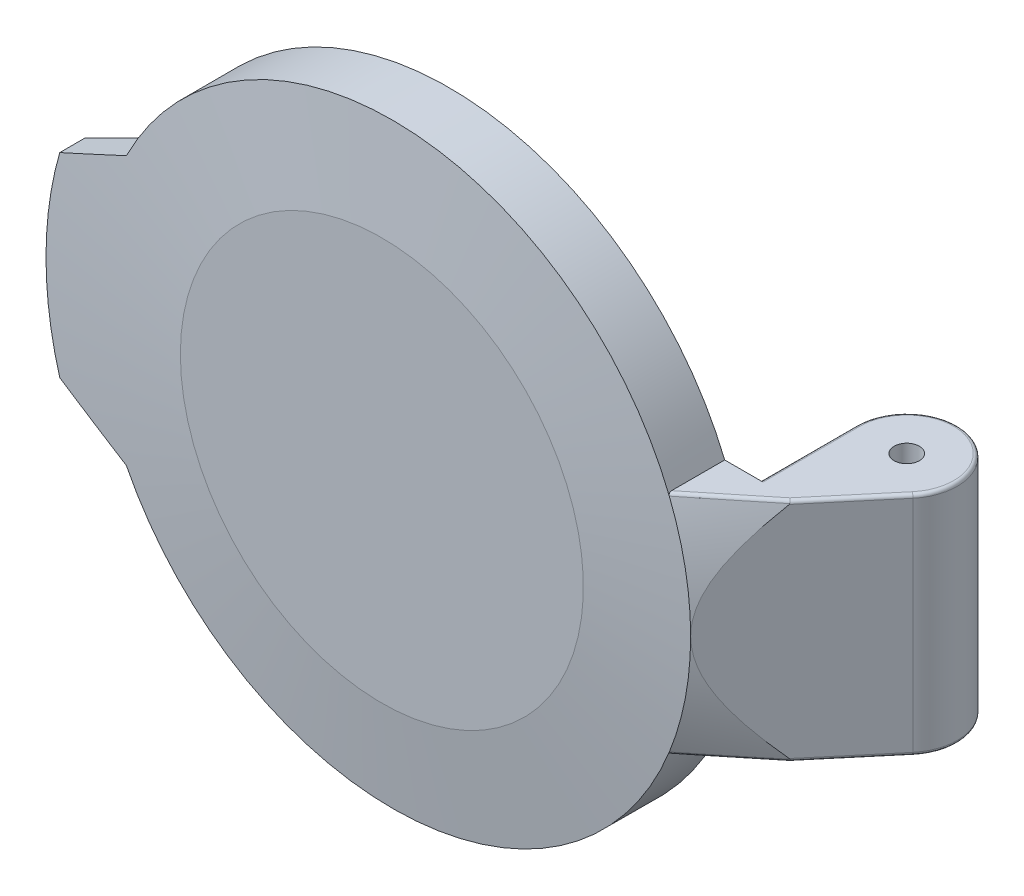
ISO-10303-21;
HEADER;
FILE_DESCRIPTION(('STEP AP214'),'2;1');
FILE_NAME('part.step','',(''),(''),'','','');
FILE_SCHEMA(('AUTOMOTIVE_DESIGN { 1 0 10303 214 1 1 1 1 }'));
ENDSEC;
DATA;
#1=APPLICATION_CONTEXT('core data for automotive mechanical design processes');
#2=APPLICATION_PROTOCOL_DEFINITION('international standard','automotive_design',2000,#1);
#3=PRODUCT_CONTEXT('',#1,'mechanical');
#4=PRODUCT('Part','Part','',(#3));
#5=PRODUCT_RELATED_PRODUCT_CATEGORY('part','',(#4));
#6=PRODUCT_DEFINITION_FORMATION('','',#4);
#7=PRODUCT_DEFINITION_CONTEXT('part definition',#1,'design');
#8=PRODUCT_DEFINITION('design','',#6,#7);
#9=PRODUCT_DEFINITION_SHAPE('','',#8);
#10=(LENGTH_UNIT() NAMED_UNIT(*) SI_UNIT(.MILLI.,.METRE.));
#11=(NAMED_UNIT(*) PLANE_ANGLE_UNIT() SI_UNIT($,.RADIAN.));
#12=(NAMED_UNIT(*) SI_UNIT($,.STERADIAN.) SOLID_ANGLE_UNIT());
#13=UNCERTAINTY_MEASURE_WITH_UNIT(LENGTH_MEASURE(1.E-05),#10,'distance_accuracy_value','');
#14=(GEOMETRIC_REPRESENTATION_CONTEXT(3) GLOBAL_UNCERTAINTY_ASSIGNED_CONTEXT((#13)) GLOBAL_UNIT_ASSIGNED_CONTEXT((#10,
#11,#12)) REPRESENTATION_CONTEXT('',''));
#15=CARTESIAN_POINT('',(0.,0.,0.));
#16=DIRECTION('',(0.,0.,1.));
#17=DIRECTION('',(1.,0.,0.));
#18=AXIS2_PLACEMENT_3D('',#15,#16,#17);
#19=CARTESIAN_POINT('',(43.,-13.5,-9.51359459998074));
#20=DIRECTION('',(0.,1.,0.));
#21=DIRECTION('',(0.,0.,1.));
#22=AXIS2_PLACEMENT_3D('',#19,#20,#21);
#23=PLANE('',#22);
#24=CARTESIAN_POINT('',(43.,-13.5,-9.51359459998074));
#25=DIRECTION('',(0.,1.,0.));
#26=DIRECTION('',(0.,0.,1.));
#27=AXIS2_PLACEMENT_3D('',#24,#25,#26);
#28=CIRCLE('',#27,1.5);
#29=CARTESIAN_POINT('',(43.,-13.5,-8.01359459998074));
#30=VERTEX_POINT('',#29);
#31=EDGE_CURVE('E413',#30,#30,#28,.T.);
#32=ORIENTED_EDGE('',*,*,#31,.T.);
#33=EDGE_LOOP('',(#32));
#34=FACE_BOUND('',#33,.T.);
#35=DIRECTION('',(-1.,0.,0.));
#36=VECTOR('',#35,1.);
#37=CARTESIAN_POINT('',(32.5670761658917,-13.5,2.));
#38=LINE('',#37,#36);
#39=CARTESIAN_POINT('',(37.4,-13.5,2.));
#40=VERTEX_POINT('',#39);
#41=CARTESIAN_POINT('',(32.832910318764,-13.5,2.));
#42=VERTEX_POINT('',#41);
#43=EDGE_CURVE('E416',#40,#42,#38,.T.);
#44=ORIENTED_EDGE('',*,*,#43,.F.);
#45=DIRECTION('',(0.,0.,1.));
#46=VECTOR('',#45,1.);
#47=CARTESIAN_POINT('',(37.4,-13.5,-9.51359459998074));
#48=LINE('',#47,#46);
#49=CARTESIAN_POINT('',(37.4,-13.5,-9.51359459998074));
#50=VERTEX_POINT('',#49);
#51=EDGE_CURVE('E501',#40,#50,#48,.F.);
#52=ORIENTED_EDGE('',*,*,#51,.T.);
#53=CARTESIAN_POINT('',(43.,-13.5,-9.51359459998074));
#54=DIRECTION('',(0.,1.,0.));
#55=DIRECTION('',(0.,0.,1.));
#56=AXIS2_PLACEMENT_3D('',#53,#54,#55);
#57=CIRCLE('',#56,5.6);
#58=CARTESIAN_POINT('',(47.2853281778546,-13.5,-5.90860328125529));
#59=VERTEX_POINT('',#58);
#60=EDGE_CURVE('E538',#50,#59,#57,.F.);
#61=ORIENTED_EDGE('',*,*,#60,.T.);
#62=DIRECTION('',(0.643748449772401,0.,-0.765237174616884));
#63=VECTOR('',#62,1.);
#64=CARTESIAN_POINT('',(40.8441244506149,-13.5,1.74818959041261));
#65=LINE('',#64,#63);
#66=CARTESIAN_POINT('',(40.6102392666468,-13.5,2.02621377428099));
#67=VERTEX_POINT('',#66);
#68=EDGE_CURVE('E212',#59,#67,#65,.F.);
#69=ORIENTED_EDGE('',*,*,#68,.T.);
#70=CARTESIAN_POINT('',(63.8326760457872,-13.1526421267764,-16.8030956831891));
#71=CARTESIAN_POINT('',(63.8029633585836,-13.5,-16.8383628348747));
#72=CARTESIAN_POINT('',(63.577192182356,-13.5,-17.1063394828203));
#73=CARTESIAN_POINT('',(62.7224714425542,-13.1535240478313,-15.8679040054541));
#74=CARTESIAN_POINT('',(62.6934024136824,-13.5,-15.9045877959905));
#75=CARTESIAN_POINT('',(62.4671693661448,-13.5,-16.1711478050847));
#76=CARTESIAN_POINT('',(61.6117695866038,-13.1544490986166,-14.9332869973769));
#77=CARTESIAN_POINT('',(61.582395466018,-13.5,-14.970621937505));
#78=CARTESIAN_POINT('',(61.3566627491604,-13.5,-15.2365307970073));
#79=CARTESIAN_POINT('',(59.3891801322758,-13.1564011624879,-13.0654245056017));
#80=CARTESIAN_POINT('',(59.3588956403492,-13.5,-13.1038992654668));
#81=CARTESIAN_POINT('',(59.1344977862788,-13.5,-13.3686683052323));
#82=CARTESIAN_POINT('',(58.27729253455,-13.157428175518,-12.1321790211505));
#83=CARTESIAN_POINT('',(58.2466466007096,-13.5,-12.1713419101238));
#84=CARTESIAN_POINT('',(58.0228394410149,-13.5,-12.4354228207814));
#85=CARTESIAN_POINT('',(54.9402735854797,-13.160685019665,-9.33542759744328));
#86=CARTESIAN_POINT('',(54.9121393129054,-13.5,-9.37980792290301));
#87=CARTESIAN_POINT('',(54.6865697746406,-13.5,-9.63867139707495));
#88=CARTESIAN_POINT('',(52.7130766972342,-13.1630911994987,-7.47430864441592));
#89=CARTESIAN_POINT('',(52.6851920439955,-13.5,-7.52112394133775));
#90=CARTESIAN_POINT('',(52.4599545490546,-13.5,-7.77755244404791));
#91=CARTESIAN_POINT('',(49.3679121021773,-13.1671955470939,-4.69084179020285));
#92=CARTESIAN_POINT('',(49.3332737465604,-13.5,-4.73580265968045));
#93=CARTESIAN_POINT('',(49.1158607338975,-13.5,-4.99408558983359));
#94=CARTESIAN_POINT('',(48.2529188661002,-13.1686449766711,-3.76503974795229));
#95=CARTESIAN_POINT('',(48.2178910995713,-13.5,-3.81098051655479));
#96=CARTESIAN_POINT('',(48.0012571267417,-13.5,-4.06828354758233));
#97=CARTESIAN_POINT('',(46.0205098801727,-13.1717438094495,-1.91626441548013));
#98=CARTESIAN_POINT('',(45.9842070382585,-13.5,-1.96390830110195));
#99=CARTESIAN_POINT('',(45.7697138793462,-13.5,-2.21950821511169));
#100=CARTESIAN_POINT('',(44.9030941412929,-13.173393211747,-0.993291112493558));
#101=CARTESIAN_POINT('',(44.8663706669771,-13.5,-1.04202638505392));
#102=CARTESIAN_POINT('',(44.6527742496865,-13.5,-1.29653491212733));
#103=CARTESIAN_POINT('',(42.6649200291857,-13.1769349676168,0.849453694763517));
#104=CARTESIAN_POINT('',(42.6267914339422,-13.5,0.798821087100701));
#105=CARTESIAN_POINT('',(42.4156658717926,-13.5,0.546209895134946));
#106=CARTESIAN_POINT('',(41.5441607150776,-13.1788273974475,1.76922410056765));
#107=CARTESIAN_POINT('',(41.505605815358,-13.5,1.71734944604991));
#108=CARTESIAN_POINT('',(41.2954962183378,-13.5,1.4659803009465));
#109=CARTESIAN_POINT('',(39.2988707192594,-13.1829102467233,3.60438124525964));
#110=CARTESIAN_POINT('',(39.2587817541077,-13.5,3.55037061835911));
#111=CARTESIAN_POINT('',(39.0515375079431,-13.5,3.30113744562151));
#112=CARTESIAN_POINT('',(38.1743399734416,-13.1851006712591,4.51976790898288));
#113=CARTESIAN_POINT('',(38.13382515,-13.5,4.46433945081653));
#114=CARTESIAN_POINT('',(37.9277483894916,-13.5,4.21652410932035));
#115=CARTESIAN_POINT('',(35.9175092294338,-13.1898581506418,6.3473139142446));
#116=CARTESIAN_POINT('',(35.8753353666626,-13.5,6.28945362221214));
#117=CARTESIAN_POINT('',(35.6726110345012,-13.5,6.04407011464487));
#118=CARTESIAN_POINT('',(34.7851965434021,-13.1924261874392,7.25945829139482));
#119=CARTESIAN_POINT('',(34.7426186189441,-13.5,7.19996094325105));
#120=CARTESIAN_POINT('',(34.5412506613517,-13.5,6.95621449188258));
#121=CARTESIAN_POINT('',(32.5143752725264,-13.1980310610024,9.07625079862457));
#122=CARTESIAN_POINT('',(32.4699882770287,-13.5,9.01399256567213));
#123=CARTESIAN_POINT('',(32.2726269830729,-13.5,8.77300699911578));
#124=CARTESIAN_POINT('',(31.3758670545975,-13.2010678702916,9.98089936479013));
#125=CARTESIAN_POINT('',(31.3311327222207,-13.5,9.91674467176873));
#126=CARTESIAN_POINT('',(31.13536402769,-13.5,9.67765556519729));
#127=CARTESIAN_POINT('',(29.0914407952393,-13.2077371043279,11.7794129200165));
#128=CARTESIAN_POINT('',(29.0447757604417,-13.5,11.7121007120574));
#129=CARTESIAN_POINT('',(28.8538504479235,-13.5,11.476169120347));
#130=CARTESIAN_POINT('',(27.9455296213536,-13.2113690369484,12.6732861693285));
#131=CARTESIAN_POINT('',(27.8986229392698,-13.5,12.6037706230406));
#132=CARTESIAN_POINT('',(27.709606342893,-13.5,12.3700423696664));
#133=CARTESIAN_POINT('',(25.6420605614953,-13.2194039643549,14.44732842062));
#134=CARTESIAN_POINT('',(25.5932010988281,-13.5,14.3741611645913));
#135=CARTESIAN_POINT('',(25.4100985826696,-13.5,14.1440846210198));
#136=CARTESIAN_POINT('',(24.4845001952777,-13.2238071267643,15.3274943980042));
#137=CARTESIAN_POINT('',(24.435634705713,-13.5,15.25174738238));
#138=CARTESIAN_POINT('',(24.2548325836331,-13.5,15.0242505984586));
#139=CARTESIAN_POINT('',(22.7343896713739,-13.2311698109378,16.6337447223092));
#140=CARTESIAN_POINT('',(22.6800454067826,-13.5,16.5578500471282));
#141=CARTESIAN_POINT('',(22.5089002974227,-13.5,16.3305009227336));
#142=CARTESIAN_POINT('',(22.1478917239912,-13.2337545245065,17.0674271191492));
#143=CARTESIAN_POINT('',(22.0932555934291,-13.5,16.9903372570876));
#144=CARTESIAN_POINT('',(21.9239205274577,-13.5,16.7641833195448));
#145=CARTESIAN_POINT('',(20.9699635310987,-13.239210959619,17.9284750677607));
#146=CARTESIAN_POINT('',(20.9144912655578,-13.5,17.849089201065));
#147=CARTESIAN_POINT('',(20.7493420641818,-13.5,17.6252312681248));
#148=CARTESIAN_POINT('',(20.3785333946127,-13.242082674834,18.355840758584));
#149=CARTESIAN_POINT('',(20.3228342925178,-13.5,18.2751734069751));
#150=CARTESIAN_POINT('',(20.159743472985,-13.5,18.0525969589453));
#151=CARTESIAN_POINT('',(19.1900322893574,-13.2481482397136,19.2024800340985));
#152=CARTESIAN_POINT('',(19.1336321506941,-13.5,19.119345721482));
#153=CARTESIAN_POINT('',(18.9753031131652,-13.5,18.8992362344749));
#154=CARTESIAN_POINT('',(18.592965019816,-13.2513418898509,19.6217584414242));
#155=CARTESIAN_POINT('',(18.5364511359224,-13.5,19.537250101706));
#156=CARTESIAN_POINT('',(18.3804647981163,-13.5,19.3185146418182));
#157=CARTESIAN_POINT('',(17.3914025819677,-13.2580905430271,20.4504747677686));
#158=CARTESIAN_POINT('',(17.3344218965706,-13.5,20.3633148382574));
#159=CARTESIAN_POINT('',(17.1838738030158,-13.5,20.1472309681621));
#160=CARTESIAN_POINT('',(16.7869067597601,-13.2616455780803,20.8599118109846));
#161=CARTESIAN_POINT('',(16.7299745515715,-13.5,20.771289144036));
#162=CARTESIAN_POINT('',(16.5821205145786,-13.5,20.5566680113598));
#163=CARTESIAN_POINT('',(15.5669133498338,-13.2691599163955,21.6673257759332));
#164=CARTESIAN_POINT('',(15.5098856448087,-13.5,21.5758535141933));
#165=CARTESIAN_POINT('',(15.368288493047,-13.5,21.3640819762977));
#166=CARTESIAN_POINT('',(14.9513877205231,-13.2731204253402,22.0652637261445));
#167=CARTESIAN_POINT('',(14.8946484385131,-13.5,21.9722439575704));
#168=CARTESIAN_POINT('',(14.7561837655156,-13.5,21.7620199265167));
#169=CARTESIAN_POINT('',(13.708999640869,-13.2814514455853,22.8443484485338));
#170=CARTESIAN_POINT('',(13.6526946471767,-13.5,22.7483144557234));
#171=CARTESIAN_POINT('',(13.5215136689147,-13.5,22.5411046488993));
#172=CARTESIAN_POINT('',(13.0821401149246,-13.285821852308,23.2254994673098));
#173=CARTESIAN_POINT('',(13.0264560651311,-13.5,23.1278728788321));
#174=CARTESIAN_POINT('',(12.8989510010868,-13.5,22.922255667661));
#175=CARTESIAN_POINT('',(12.1304256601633,-13.2926691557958,23.780820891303));
#176=CARTESIAN_POINT('',(12.0738552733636,-13.5,23.6818791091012));
#177=CARTESIAN_POINT('',(11.9545483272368,-13.5,23.4775770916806));
#178=CARTESIAN_POINT('',(11.8109315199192,-13.2950028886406,23.9633824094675));
#179=CARTESIAN_POINT('',(11.7547680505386,-13.5,23.8636400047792));
#180=CARTESIAN_POINT('',(11.6376391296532,-13.5,23.6601386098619));
#181=CARTESIAN_POINT('',(11.1679241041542,-13.2997548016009,24.321915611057));
#182=CARTESIAN_POINT('',(11.1126671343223,-13.5,24.2205597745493));
#183=CARTESIAN_POINT('',(11.0001312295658,-13.5,24.0186718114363));
#184=CARTESIAN_POINT('',(10.8444110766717,-13.3021729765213,24.4978876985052));
#185=CARTESIAN_POINT('',(10.7897070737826,-13.5,24.3957241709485));
#186=CARTESIAN_POINT('',(10.6795327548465,-13.5,24.1946438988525));
#187=CARTESIAN_POINT('',(10.1926214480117,-13.3070793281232,24.8423047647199));
#188=CARTESIAN_POINT('',(10.1391444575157,-13.5,24.7385167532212));
#189=CARTESIAN_POINT('',(10.0339486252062,-13.5,24.5390609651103));
#190=CARTESIAN_POINT('',(9.86434101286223,-13.3095675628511,25.0107431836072));
#191=CARTESIAN_POINT('',(9.81158311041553,-13.5,24.9061550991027));
#192=CARTESIAN_POINT('',(9.70895945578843,-13.5,24.7074993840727));
#193=CARTESIAN_POINT('',(9.20274545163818,-13.3145828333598,25.3385713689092));
#194=CARTESIAN_POINT('',(9.1516073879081,-13.5,25.2323520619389));
#195=CARTESIAN_POINT('',(9.05436849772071,-13.5,25.0353275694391));
#196=CARTESIAN_POINT('',(8.86942925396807,-13.3171098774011,25.4979591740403));
#197=CARTESIAN_POINT('',(8.81922351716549,-13.5,25.3909399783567));
#198=CARTESIAN_POINT('',(8.72476572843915,-13.5,25.1947153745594));
#199=CARTESIAN_POINT('',(8.53339499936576,-13.3196411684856,25.6521041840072));
#200=CARTESIAN_POINT('',(8.48351613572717,-13.5,25.5446148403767));
#201=CARTESIAN_POINT('',(8.39267913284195,-13.5,25.3488603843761));
#202=(BOUNDED_SURFACE() B_SPLINE_SURFACE(3,2,((#70,#71,#72),(#73,#74,#75),(#76,#77,#78),(#79,
#80,#81),(#82,#83,#84),(#85,#86,#87),(#88,#89,#90),(#91,#92,#93),(#94,#95,#96),(#97,#98,#99),
(#100,#101,#102),(#103,#104,#105),(#106,#107,#108),(#109,#110,#111),(#112,#113,#114),(#115,#116,
#117),(#118,#119,#120),(#121,#122,#123),(#124,#125,#126),(#127,#128,#129),(#130,#131,#132),
(#133,#134,#135),(#136,#137,#138),(#139,#140,#141),(#142,#143,#144),(#145,#146,#147),(#148,#149,
#150),(#151,#152,#153),(#154,#155,#156),(#157,#158,#159),(#160,#161,#162),(#163,#164,#165),
(#166,#167,#168),(#169,#170,#171),(#172,#173,#174),(#175,#176,#177),(#178,#179,#180),(#181,#182,
#183),(#184,#185,#186),(#187,#188,#189),(#190,#191,#192),(#193,#194,#195),(#196,#197,#198),
(#199,#200,#201)),.UNSPECIFIED.,.F.,.F.,.F.) B_SPLINE_SURFACE_WITH_KNOTS((4,2,2,2,2,2,2,2,2,2,2,
2,2,2,2,2,2,2,2,2,2,4),(3,3),(0.,4.35437699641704,8.70875160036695,17.4147175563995,
21.7615584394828,26.1083796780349,30.4565682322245,34.8048310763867,39.1646080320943,
43.5241295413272,47.8800640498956,52.2369464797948,54.4215278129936,56.606060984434,
58.7892484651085,60.9726295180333,63.1627026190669,65.3522184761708,66.4493524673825,
67.546419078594,68.6444230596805,69.7426640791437),(0.,1.),
.UNSPECIFIED.) GEOMETRIC_REPRESENTATION_ITEM() RATIONAL_B_SPLINE_SURFACE(((1.,0.752198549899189,
1.),(1.,0.752931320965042,1.),(1.,0.753698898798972,1.),(1.,0.755315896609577,1.),(1.,
0.756165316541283,1.),(1.,0.758854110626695,1.),(1.,0.760834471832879,1.),(1.,0.764196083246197,
1.),(1.,0.765380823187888,1.),(1.,0.767907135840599,1.),(1.,0.769248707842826,1.),(1.,
0.772120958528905,1.),(1.,0.773651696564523,1.),(1.,0.776943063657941,1.),(1.,0.778703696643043,
1.),(1.,0.782512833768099,1.),(1.,0.784562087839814,1.),(1.,0.789014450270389,1.),(1.,
0.791417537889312,1.),(1.,0.796666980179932,1.),(1.,0.799512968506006,1.),(1.,0.805769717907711,
1.),(1.,0.809180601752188,1.),(1.,0.814840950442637,1.),(1.,0.816821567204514,1.),(1.,
0.820986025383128,1.),(1.,0.823169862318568,1.),(1.,0.827762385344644,1.),(1.,0.830170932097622,
1.),(1.,0.835236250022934,1.),(1.,0.837893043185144,1.),(1.,0.84347953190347,1.),(1.,
0.846410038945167,1.),(1.,0.852539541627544,1.),(1.,0.855738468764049,1.),(1.,0.860720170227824,
1.),(1.,0.862413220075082,1.),(1.,0.865850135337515,1.),(1.,0.867593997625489,1.),(1.,
0.871121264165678,1.),(1.,0.872904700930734,1.),(1.,0.876488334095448,1.),(1.,0.878288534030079,
1.),(1.,0.880086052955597,1.))) REPRESENTATION_ITEM('') SURFACE());
#203=CARTESIAN_POINT('',(63.577192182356,-13.5,-17.1063394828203));
#204=CARTESIAN_POINT('',(62.4671693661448,-13.5,-16.1711478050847));
#205=CARTESIAN_POINT('',(61.3566627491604,-13.5,-15.2365307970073));
#206=CARTESIAN_POINT('',(59.1344977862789,-13.5,-13.3686683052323));
#207=CARTESIAN_POINT('',(58.0228394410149,-13.5,-12.4354228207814));
#208=CARTESIAN_POINT('',(54.6865697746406,-13.5,-9.63867139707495));
#209=CARTESIAN_POINT('',(52.4599545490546,-13.5,-7.77755244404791));
#210=CARTESIAN_POINT('',(49.1158607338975,-13.5,-4.99408558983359));
#211=CARTESIAN_POINT('',(48.0012571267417,-13.5,-4.06828354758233));
#212=CARTESIAN_POINT('',(45.7697138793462,-13.5,-2.21950821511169));
#213=CARTESIAN_POINT('',(44.6527742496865,-13.5,-1.29653491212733));
#214=CARTESIAN_POINT('',(42.4156658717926,-13.5,0.546209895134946));
#215=CARTESIAN_POINT('',(41.2954962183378,-13.5,1.4659803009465));
#216=CARTESIAN_POINT('',(39.0515375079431,-13.5,3.30113744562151));
#217=CARTESIAN_POINT('',(37.9277483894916,-13.5,4.21652410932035));
#218=CARTESIAN_POINT('',(35.6726110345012,-13.5,6.04407011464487));
#219=CARTESIAN_POINT('',(34.5412506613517,-13.5,6.95621449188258));
#220=CARTESIAN_POINT('',(32.2726269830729,-13.5,8.77300699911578));
#221=CARTESIAN_POINT('',(31.13536402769,-13.5,9.67765556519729));
#222=CARTESIAN_POINT('',(28.8538504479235,-13.5,11.476169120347));
#223=CARTESIAN_POINT('',(27.709606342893,-13.5,12.3700423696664));
#224=CARTESIAN_POINT('',(25.4100985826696,-13.5,14.1440846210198));
#225=CARTESIAN_POINT('',(24.2548325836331,-13.5,15.0242505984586));
#226=CARTESIAN_POINT('',(22.5089002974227,-13.5,16.3305009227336));
#227=CARTESIAN_POINT('',(21.9239205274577,-13.5,16.7641833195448));
#228=CARTESIAN_POINT('',(20.7493420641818,-13.5,17.6252312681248));
#229=CARTESIAN_POINT('',(20.159743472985,-13.5,18.0525969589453));
#230=CARTESIAN_POINT('',(18.9753031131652,-13.5,18.8992362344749));
#231=CARTESIAN_POINT('',(18.3804647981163,-13.5,19.3185146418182));
#232=CARTESIAN_POINT('',(17.1838738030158,-13.5,20.1472309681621));
#233=CARTESIAN_POINT('',(16.5821205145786,-13.5,20.5566680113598));
#234=CARTESIAN_POINT('',(15.368288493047,-13.5,21.3640819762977));
#235=CARTESIAN_POINT('',(14.7561837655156,-13.5,21.7620199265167));
#236=CARTESIAN_POINT('',(13.5215136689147,-13.5,22.5411046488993));
#237=CARTESIAN_POINT('',(12.8989510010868,-13.5,22.922255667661));
#238=CARTESIAN_POINT('',(11.9545483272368,-13.5,23.4775770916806));
#239=CARTESIAN_POINT('',(11.6376391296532,-13.5,23.6601386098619));
#240=CARTESIAN_POINT('',(11.0001312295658,-13.5,24.0186718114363));
#241=CARTESIAN_POINT('',(10.6795327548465,-13.5,24.1946438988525));
#242=CARTESIAN_POINT('',(10.0339486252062,-13.5,24.5390609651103));
#243=CARTESIAN_POINT('',(9.70895945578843,-13.5,24.7074993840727));
#244=CARTESIAN_POINT('',(9.05436849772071,-13.5,25.0353275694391));
#245=CARTESIAN_POINT('',(8.72476572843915,-13.5,25.1947153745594));
#246=CARTESIAN_POINT('',(8.39267913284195,-13.5,25.3488603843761));
#247=B_SPLINE_CURVE_WITH_KNOTS('',3,(#203,#204,#205,#206,#207,#208,#209,#210,#211,#212,#213,
#214,#215,#216,#217,#218,#219,#220,#221,#222,#223,#224,#225,#226,#227,#228,#229,#230,#231,#232,
#233,#234,#235,#236,#237,#238,#239,#240,#241,#242,#243,#244,#245,#246),.UNSPECIFIED.,.F.,.F.,(4,
2,2,2,2,2,2,2,2,2,2,2,2,2,2,2,2,2,2,2,2,4),(0.,4.35437699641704,8.70875160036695,
17.4147175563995,21.7615584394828,26.1083796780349,30.4565682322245,34.8048310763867,
39.1646080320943,43.5241295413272,47.8800640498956,52.2369464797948,54.4215278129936,
56.606060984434,58.7892484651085,60.9726295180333,63.1627026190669,65.3522184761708,
66.4493524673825,67.546419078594,68.6444230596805,69.7426640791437),.UNSPECIFIED.);
#248=CARTESIAN_POINT('',(32.832910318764,-13.5,8.3237763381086));
#249=VERTEX_POINT('',#248);
#250=EDGE_CURVE('E205',#67,#249,#247,.T.);
#251=ORIENTED_EDGE('',*,*,#250,.T.);
#252=DIRECTION('',(0.,0.,1.));
#253=VECTOR('',#252,1.);
#254=CARTESIAN_POINT('',(32.832910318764,-13.5,-22.));
#255=LINE('',#254,#253);
#256=EDGE_CURVE('E190',#249,#42,#255,.F.);
#257=ORIENTED_EDGE('',*,*,#256,.T.);
#258=EDGE_LOOP('',(#44,#52,#61,#69,#251,#257));
#259=FACE_BOUND('',#258,.T.);
#260=ADVANCED_FACE('F36',(#34,#259),#23,.F.);
#261=CARTESIAN_POINT('',(43.,13.5,-9.51359459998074));
#262=DIRECTION('',(0.,1.,0.));
#263=DIRECTION('',(0.,0.,1.));
#264=AXIS2_PLACEMENT_3D('',#261,#262,#263);
#265=PLANE('',#264);
#266=CARTESIAN_POINT('',(43.,13.5,-9.51359459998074));
#267=DIRECTION('',(0.,1.,0.));
#268=DIRECTION('',(0.,0.,1.));
#269=AXIS2_PLACEMENT_3D('',#266,#267,#268);
#270=CIRCLE('',#269,1.5);
#271=CARTESIAN_POINT('',(43.,13.5,-8.01359459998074));
#272=VERTEX_POINT('',#271);
#273=EDGE_CURVE('E407',#272,#272,#270,.T.);
#274=ORIENTED_EDGE('',*,*,#273,.F.);
#275=EDGE_LOOP('',(#274));
#276=FACE_BOUND('',#275,.T.);
#277=DIRECTION('',(0.,0.,1.));
#278=VECTOR('',#277,1.);
#279=CARTESIAN_POINT('',(37.4,13.5,-9.51359459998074));
#280=LINE('',#279,#278);
#281=CARTESIAN_POINT('',(37.4,13.5,-9.51359459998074));
#282=VERTEX_POINT('',#281);
#283=CARTESIAN_POINT('',(37.4,13.5,2.));
#284=VERTEX_POINT('',#283);
#285=EDGE_CURVE('E533',#282,#284,#280,.T.);
#286=ORIENTED_EDGE('',*,*,#285,.T.);
#287=DIRECTION('',(-1.,0.,0.));
#288=VECTOR('',#287,1.);
#289=CARTESIAN_POINT('',(32.5670761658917,13.5,2.));
#290=LINE('',#289,#288);
#291=CARTESIAN_POINT('',(32.832910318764,13.5,2.));
#292=VERTEX_POINT('',#291);
#293=EDGE_CURVE('E410',#284,#292,#290,.T.);
#294=ORIENTED_EDGE('',*,*,#293,.T.);
#295=DIRECTION('',(0.,0.,1.));
#296=VECTOR('',#295,1.);
#297=CARTESIAN_POINT('',(32.832910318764,13.5,-22.));
#298=LINE('',#297,#296);
#299=CARTESIAN_POINT('',(32.832910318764,13.5,8.3237763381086));
#300=VERTEX_POINT('',#299);
#301=EDGE_CURVE('E187',#300,#292,#298,.F.);
#302=ORIENTED_EDGE('',*,*,#301,.F.);
#303=CARTESIAN_POINT('',(23.6345671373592,13.2273942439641,15.9614649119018));
#304=CARTESIAN_POINT('',(23.5795829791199,13.5,15.8882151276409));
#305=CARTESIAN_POINT('',(23.4069404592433,13.5,15.6582211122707));
#306=CARTESIAN_POINT('',(24.203707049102,13.2250414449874,15.5351887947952));
#307=CARTESIAN_POINT('',(24.1504197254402,13.5,15.4620285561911));
#308=CARTESIAN_POINT('',(23.9747650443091,13.5,15.2319449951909));
#309=CARTESIAN_POINT('',(24.7709988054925,13.2228048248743,15.1066082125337));
#310=CARTESIAN_POINT('',(24.7180812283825,13.5,15.0344991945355));
#311=CARTESIAN_POINT('',(24.5408514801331,13.5,14.8033644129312));
#312=CARTESIAN_POINT('',(25.902383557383,13.2185386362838,14.2455090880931));
#313=CARTESIAN_POINT('',(25.8504258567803,13.5,14.1752975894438));
#314=CARTESIAN_POINT('',(25.670009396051,13.5,13.942265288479));
#315=CARTESIAN_POINT('',(26.4664765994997,13.2165090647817,13.8129906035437));
#316=CARTESIAN_POINT('',(26.4148852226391,13.5,13.7437688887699));
#317=CARTESIAN_POINT('',(26.2330809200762,13.5,13.5097468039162));
#318=CARTESIAN_POINT('',(27.5919467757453,13.2126317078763,12.9446982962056));
#319=CARTESIAN_POINT('',(27.541305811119,13.5,12.8772516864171));
#320=CARTESIAN_POINT('',(27.3566556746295,13.5,12.6414544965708));
#321=CARTESIAN_POINT('',(28.1533240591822,13.2107839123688,12.5089246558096));
#322=CARTESIAN_POINT('',(28.1030703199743,13.5,12.4423944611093));
#323=CARTESIAN_POINT('',(27.9171590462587,13.5,12.2056808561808));
#324=CARTESIAN_POINT('',(29.2737777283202,13.207248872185,11.6345853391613));
#325=CARTESIAN_POINT('',(29.2244709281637,13.5,11.5697084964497));
#326=CARTESIAN_POINT('',(29.0359865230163,13.5,11.3313415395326));
#327=CARTESIAN_POINT('',(29.8328541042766,13.2055616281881,11.1960196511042));
#328=CARTESIAN_POINT('',(29.7839322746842,13.5,11.1319996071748));
#329=CARTESIAN_POINT('',(29.5943106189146,13.5,10.8927758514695));
#330=CARTESIAN_POINT('',(31.5069819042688,13.2007124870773,9.87688226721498));
#331=CARTESIAN_POINT('',(31.4621656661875,13.5,9.81304801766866));
#332=CARTESIAN_POINT('',(31.2663312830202,13.5,9.573638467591));
#333=CARTESIAN_POINT('',(32.6190796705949,13.1977626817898,8.9927559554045));
#334=CARTESIAN_POINT('',(32.5746233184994,13.5,8.93075155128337));
#335=CARTESIAN_POINT('',(32.3772236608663,13.5,8.68951215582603));
#336=CARTESIAN_POINT('',(34.8373558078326,13.1923081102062,7.21743346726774));
#337=CARTESIAN_POINT('',(34.7946564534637,13.5,7.15812322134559));
#338=CARTESIAN_POINT('',(34.5933662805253,13.5,6.91418966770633));
#339=CARTESIAN_POINT('',(35.94353407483,13.1898033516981,6.32623716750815));
#340=CARTESIAN_POINT('',(35.9012510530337,13.5,6.26850825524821));
#341=CARTESIAN_POINT('',(35.6986164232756,13.5,6.02299336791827));
#342=CARTESIAN_POINT('',(38.1748047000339,13.1850996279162,4.51939386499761));
#343=CARTESIAN_POINT('',(38.1342956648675,13.5,4.4639618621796));
#344=CARTESIAN_POINT('',(37.9282126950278,13.5,4.21615006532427));
#345=CARTESIAN_POINT('',(39.2997982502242,13.1829083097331,3.60363030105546));
#346=CARTESIAN_POINT('',(39.2597181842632,13.5,3.54961440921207));
#347=CARTESIAN_POINT('',(39.052464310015,13.5,3.3003865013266));
#348=CARTESIAN_POINT('',(41.5460263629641,13.1788242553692,1.76769207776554));
#349=CARTESIAN_POINT('',(41.5074678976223,13.5,1.71582251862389));
#350=CARTESIAN_POINT('',(41.2973609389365,13.5,1.46444827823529));
#351=CARTESIAN_POINT('',(42.6672609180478,13.1769315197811,0.847517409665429));
#352=CARTESIAN_POINT('',(42.6291113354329,13.5,0.796903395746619));
#353=CARTESIAN_POINT('',(42.4180059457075,13.5,0.54427361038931));
#354=CARTESIAN_POINT('',(46.0265159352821,13.1716149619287,-1.91821448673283));
#355=CARTESIAN_POINT('',(45.9968427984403,13.5,-1.97120898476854));
#356=CARTESIAN_POINT('',(45.7756605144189,13.5,-2.22145828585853));
#357=CARTESIAN_POINT('',(48.2600815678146,13.1685528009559,-3.76897458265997));
#358=CARTESIAN_POINT('',(48.2298132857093,13.5,-3.81880448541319));
#359=CARTESIAN_POINT('',(48.0083834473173,13.5,-4.0722183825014));
#360=CARTESIAN_POINT('',(52.7199405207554,13.1630847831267,-7.48007631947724));
#361=CARTESIAN_POINT('',(52.6919743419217,13.5,-7.52682332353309));
#362=CARTESIAN_POINT('',(52.4668175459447,13.5,-7.78332011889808));
#363=CARTESIAN_POINT('',(54.9462318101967,13.1606790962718,-9.34042031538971));
#364=CARTESIAN_POINT('',(54.9180789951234,13.5,-9.38478072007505));
#365=CARTESIAN_POINT('',(54.6925267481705,13.5,-9.64366411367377));
#366=CARTESIAN_POINT('',(58.2814975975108,13.1574241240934,-12.1357036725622));
#367=CARTESIAN_POINT('',(58.2508597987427,13.5,-12.1748688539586));
#368=CARTESIAN_POINT('',(58.0270435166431,13.5,-12.4389474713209));
#369=CARTESIAN_POINT('',(59.3925435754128,13.1563980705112,-13.0682474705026));
#370=CARTESIAN_POINT('',(59.3622629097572,13.5,-13.1067221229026));
#371=CARTESIAN_POINT('',(59.1378605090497,13.5,-13.3714912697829));
#372=CARTESIAN_POINT('',(61.6134497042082,13.1544477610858,-14.9347026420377));
#373=CARTESIAN_POINT('',(61.5840698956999,13.5,-14.9720318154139));
#374=CARTESIAN_POINT('',(61.3583426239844,13.5,-15.2379464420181));
#375=CARTESIAN_POINT('',(62.7233098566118,13.1535235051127,-15.8686140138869));
#376=CARTESIAN_POINT('',(62.6942305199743,13.5,-15.9052892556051));
#377=CARTESIAN_POINT('',(62.4680077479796,13.5,-16.1718578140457));
#378=CARTESIAN_POINT('',(63.8326760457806,13.1526421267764,-16.8030956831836));
#379=CARTESIAN_POINT('',(63.802963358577,13.5,-16.8383628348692));
#380=CARTESIAN_POINT('',(63.5771921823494,13.5,-17.1063394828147));
#381=(BOUNDED_SURFACE() B_SPLINE_SURFACE(3,2,((#303,#304,#305),(#306,#307,#308),(#309,#310,
#311),(#312,#313,#314),(#315,#316,#317),(#318,#319,#320),(#321,#322,#323),(#324,#325,#326),
(#327,#328,#329),(#330,#331,#332),(#333,#334,#335),(#336,#337,#338),(#339,#340,#341),(#342,#343,
#344),(#345,#346,#347),(#348,#349,#350),(#351,#352,#353),(#354,#355,#356),(#357,#358,#359),
(#360,#361,#362),(#363,#364,#365),(#366,#367,#368),(#369,#370,#371),(#372,#373,#374),(#375,#376,
#377),(#378,#379,#380)),.UNSPECIFIED.,.F.,.F.,.F.) B_SPLINE_SURFACE_WITH_KNOTS((4,2,2,2,2,2,2,2,
2,2,2,2,4),(3,3),(0.,2.13006092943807,4.26009073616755,6.39000207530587,8.51992242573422,
12.7792035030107,17.0385591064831,21.3886112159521,25.7386719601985,34.4388173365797,
43.141213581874,47.4923011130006,51.8433830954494),(0.,1.),
.UNSPECIFIED.) GEOMETRIC_REPRESENTATION_ITEM() RATIONAL_B_SPLINE_SURFACE(((1.,0.811937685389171,
1.),(1.,0.8101264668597,1.),(1.,0.808398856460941,1.),(1.,0.805093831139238,1.),(1.,
0.80351641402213,1.),(1.,0.800494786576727,1.),(1.,0.799050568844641,1.),(1.,0.796280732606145,
1.),(1.,0.794955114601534,1.),(1.,0.791136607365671,1.),(1.,0.788801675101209,1.),(1.,
0.784467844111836,1.),(1.,0.782468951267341,1.),(1.,0.778702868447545,1.),(1.,0.776941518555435,
1.),(1.,0.773649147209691,1.),(1.,0.772118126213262,1.),(1.,0.767806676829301,1.),(1.,
0.765307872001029,1.),(1.,0.760829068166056,1.),(1.,0.758849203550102,1.),(1.,0.756161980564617,
1.),(1.,0.755313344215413,1.),(1.,0.753697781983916,1.),(1.,0.752930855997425,1.),(1.,
0.752198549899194,1.))) REPRESENTATION_ITEM('') SURFACE());
#382=CARTESIAN_POINT('',(23.4069404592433,13.5,15.6582211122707));
#383=CARTESIAN_POINT('',(23.9747650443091,13.5,15.2319449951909));
#384=CARTESIAN_POINT('',(24.5408514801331,13.5,14.8033644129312));
#385=CARTESIAN_POINT('',(25.670009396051,13.5,13.942265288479));
#386=CARTESIAN_POINT('',(26.2330809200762,13.5,13.5097468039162));
#387=CARTESIAN_POINT('',(27.3566556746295,13.5,12.6414544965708));
#388=CARTESIAN_POINT('',(27.9171590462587,13.5,12.2056808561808));
#389=CARTESIAN_POINT('',(29.0359865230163,13.5,11.3313415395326));
#390=CARTESIAN_POINT('',(29.5943106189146,13.5,10.8927758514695));
#391=CARTESIAN_POINT('',(31.2663312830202,13.5,9.573638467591));
#392=CARTESIAN_POINT('',(32.3772236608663,13.5,8.68951215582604));
#393=CARTESIAN_POINT('',(34.5933662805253,13.5,6.91418966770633));
#394=CARTESIAN_POINT('',(35.6986164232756,13.5,6.02299336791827));
#395=CARTESIAN_POINT('',(37.9282126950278,13.5,4.21615006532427));
#396=CARTESIAN_POINT('',(39.052464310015,13.5,3.3003865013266));
#397=CARTESIAN_POINT('',(41.2973609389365,13.5,1.46444827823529));
#398=CARTESIAN_POINT('',(42.4180059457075,13.5,0.54427361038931));
#399=CARTESIAN_POINT('',(45.7756605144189,13.5,-2.22145828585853));
#400=CARTESIAN_POINT('',(48.0083834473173,13.5,-4.0722183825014));
#401=CARTESIAN_POINT('',(52.4668175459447,13.5,-7.78332011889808));
#402=CARTESIAN_POINT('',(54.6925267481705,13.5,-9.64366411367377));
#403=CARTESIAN_POINT('',(58.0270435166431,13.5,-12.4389474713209));
#404=CARTESIAN_POINT('',(59.1378605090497,13.5,-13.3714912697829));
#405=CARTESIAN_POINT('',(61.3583426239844,13.5,-15.2379464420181));
#406=CARTESIAN_POINT('',(62.4680077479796,13.5,-16.1718578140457));
#407=CARTESIAN_POINT('',(63.5771921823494,13.5,-17.1063394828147));
#408=B_SPLINE_CURVE_WITH_KNOTS('',3,(#382,#383,#384,#385,#386,#387,#388,#389,#390,#391,#392,
#393,#394,#395,#396,#397,#398,#399,#400,#401,#402,#403,#404,#405,#406,#407),.UNSPECIFIED.,.F.,
.F.,(4,2,2,2,2,2,2,2,2,2,2,2,4),(0.,2.13006092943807,4.26009073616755,6.39000207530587,
8.51992242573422,12.7792035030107,17.0385591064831,21.3886112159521,25.7386719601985,
34.4388173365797,43.141213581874,47.4923011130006,51.8433830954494),.UNSPECIFIED.);
#409=CARTESIAN_POINT('',(40.6102392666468,13.5,2.02621377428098));
#410=VERTEX_POINT('',#409);
#411=EDGE_CURVE('E283',#300,#410,#408,.T.);
#412=ORIENTED_EDGE('',*,*,#411,.T.);
#413=DIRECTION('',(0.643748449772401,0.,-0.765237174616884));
#414=VECTOR('',#413,1.);
#415=CARTESIAN_POINT('',(47.2853281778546,13.5,-5.90860328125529));
#416=LINE('',#415,#414);
#417=CARTESIAN_POINT('',(47.2853281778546,13.5,-5.90860328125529));
#418=VERTEX_POINT('',#417);
#419=EDGE_CURVE('E289',#410,#418,#416,.T.);
#420=ORIENTED_EDGE('',*,*,#419,.T.);
#421=CARTESIAN_POINT('',(43.,13.5,-9.51359459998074));
#422=DIRECTION('',(0.,1.,0.));
#423=DIRECTION('',(0.,0.,1.));
#424=AXIS2_PLACEMENT_3D('',#421,#422,#423);
#425=CIRCLE('',#424,5.6);
#426=EDGE_CURVE('E534',#418,#282,#425,.T.);
#427=ORIENTED_EDGE('',*,*,#426,.T.);
#428=EDGE_LOOP('',(#286,#294,#302,#412,#420,#427));
#429=FACE_BOUND('',#428,.T.);
#430=ADVANCED_FACE('F222',(#276,#429),#265,.T.);
#431=CARTESIAN_POINT('',(47.5914230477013,-13.5,-5.65110390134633));
#432=DIRECTION('',(0.765237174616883,0.,0.643748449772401));
#433=DIRECTION('',(0.643748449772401,0.,-0.765237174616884));
#434=AXIS2_PLACEMENT_3D('',#431,#432,#433);
#435=PLANE('',#434);
#436=CARTESIAN_POINT('',(41.1503637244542,13.5002,2.00551731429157));
#437=CARTESIAN_POINT('',(40.9601695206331,13.2367371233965,2.23160512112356));
#438=CARTESIAN_POINT('',(40.7712353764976,12.9710504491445,2.45619506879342));
#439=CARTESIAN_POINT('',(40.3963681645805,12.4345026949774,2.90180752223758));
#440=CARTESIAN_POINT('',(40.2104357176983,12.1636405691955,3.1228292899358));
#441=CARTESIAN_POINT('',(39.8410867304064,11.6145698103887,3.56188211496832));
#442=CARTESIAN_POINT('',(39.657690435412,11.3363282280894,3.77988910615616));
#443=CARTESIAN_POINT('',(39.2952096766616,10.7731681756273,4.21077752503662));
#444=CARTESIAN_POINT('',(39.11612494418,10.4882501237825,4.42365927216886));
#445=CARTESIAN_POINT('',(38.7569870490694,9.90069123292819,4.85057395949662));
#446=CARTESIAN_POINT('',(38.5771174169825,9.59777875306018,5.06438873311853));
#447=CARTESIAN_POINT('',(38.224205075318,8.98251404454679,5.48390297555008));
#448=CARTESIAN_POINT('',(38.0511617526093,8.67016266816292,5.68960317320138));
#449=CARTESIAN_POINT('',(37.7139169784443,8.03523563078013,6.09049305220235));
#450=CARTESIAN_POINT('',(37.5496971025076,7.71268370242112,6.28570463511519));
#451=CARTESIAN_POINT('',(37.2319282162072,7.0552051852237,6.66344312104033));
#452=CARTESIAN_POINT('',(37.0783756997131,6.72028271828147,6.84597419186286));
#453=CARTESIAN_POINT('',(36.8203451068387,6.11911344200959,7.15270052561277));
#454=CARTESIAN_POINT('',(36.7129854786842,5.85586823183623,7.28032114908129));
#455=CARTESIAN_POINT('',(36.5076733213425,5.32065182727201,7.52437998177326));
#456=CARTESIAN_POINT('',(36.4097224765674,5.04867908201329,7.6408161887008));
#457=CARTESIAN_POINT('',(36.1338148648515,4.22183257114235,7.96879330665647));
#458=CARTESIAN_POINT('',(35.9724239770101,3.65293178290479,8.16064201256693));
#459=CARTESIAN_POINT('',(35.7332267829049,2.57038276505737,8.44498069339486));
#460=CARTESIAN_POINT('',(35.6463724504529,2.06173026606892,8.54822624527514));
#461=CARTESIAN_POINT('',(35.5585774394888,1.28755175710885,8.65259000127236));
#462=CARTESIAN_POINT('',(35.5363936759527,1.02766979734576,8.67896030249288));
#463=CARTESIAN_POINT('',(35.506937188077,0.505818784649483,8.71397584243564));
#464=CARTESIAN_POINT('',(35.4996642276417,0.243849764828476,8.72262136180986));
#465=CARTESIAN_POINT('',(35.5003606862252,-0.280614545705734,8.72179346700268));
#466=CARTESIAN_POINT('',(35.5083640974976,-0.543109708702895,8.71227964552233));
#467=CARTESIAN_POINT('',(35.5393385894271,-1.06593904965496,8.67545962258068));
#468=CARTESIAN_POINT('',(35.5623098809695,-1.32627319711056,8.64815317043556));
#469=CARTESIAN_POINT('',(35.6223508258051,-1.84316962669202,8.57678125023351));
#470=CARTESIAN_POINT('',(35.6594315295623,-2.09972878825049,8.5327026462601));
#471=CARTESIAN_POINT('',(35.746410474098,-2.60761415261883,8.42930896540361));
#472=CARTESIAN_POINT('',(35.7963162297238,-2.85893719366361,8.36998495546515));
#473=CARTESIAN_POINT('',(36.0172009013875,-3.84545491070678,8.10741475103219));
#474=CARTESIAN_POINT('',(36.2327943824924,-4.55704137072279,7.85113429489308));
#475=CARTESIAN_POINT('',(36.6044824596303,-5.58237082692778,7.40930094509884));
#476=CARTESIAN_POINT('',(36.7371503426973,-5.91858452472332,7.25159587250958));
#477=CARTESIAN_POINT('',(37.015374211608,-6.57799079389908,6.9208653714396));
#478=CARTESIAN_POINT('',(37.1609269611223,-6.90118660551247,6.74784379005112));
#479=CARTESIAN_POINT('',(37.452087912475,-7.51452611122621,6.40173470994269));
#480=CARTESIAN_POINT('',(37.5970393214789,-7.80543363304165,6.22942795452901));
#481=CARTESIAN_POINT('',(37.8941613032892,-8.37824718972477,5.876232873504));
#482=CARTESIAN_POINT('',(38.046332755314,-8.66015212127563,5.69534350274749));
#483=CARTESIAN_POINT('',(38.5119928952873,-9.49459389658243,5.14180360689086));
#484=CARTESIAN_POINT('',(38.8343178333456,-10.0352233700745,4.75864924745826));
#485=CARTESIAN_POINT('',(39.4837171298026,-11.073576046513,3.98669479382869));
#486=CARTESIAN_POINT('',(39.8102450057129,-11.5721358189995,3.59854431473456));
#487=CARTESIAN_POINT('',(40.3078005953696,-12.3055904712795,3.00708963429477));
#488=CARTESIAN_POINT('',(40.4746843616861,-12.5473178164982,2.80871142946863));
#489=CARTESIAN_POINT('',(40.8108254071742,-13.0266930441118,2.40913357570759));
#490=CARTESIAN_POINT('',(40.9800823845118,-13.2643414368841,2.20793428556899));
#491=CARTESIAN_POINT('',(41.150363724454,-13.5002000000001,2.00551731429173));
#492=B_SPLINE_CURVE_WITH_KNOTS('',3,(#436,#437,#438,#439,#440,#441,#442,#443,#444,#445,#446,
#447,#448,#449,#450,#451,#452,#453,#454,#455,#456,#457,#458,#459,#460,#461,#462,#463,#464,#465,
#466,#467,#468,#469,#470,#471,#472,#473,#474,#475,#476,#477,#478,#479,#480,#481,#482,#483,#484,
#485,#486,#487,#488,#489,#490,#491),.UNSPECIFIED.,.F.,.F.,(4,2,2,2,2,2,2,2,2,2,2,2,2,2,2,2,2,2,
2,2,2,2,2,2,2,2,2,4),(0.,1.18758629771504,2.37541517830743,3.56997974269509,4.76446966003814,
6.0005645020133,7.2365480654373,8.46984152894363,9.70272769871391,10.6371669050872,
11.5717730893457,13.4297504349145,15.0014046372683,15.786970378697,16.5725236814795,
17.359826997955,18.1471414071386,18.9350737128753,19.7234687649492,22.0672965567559,
23.2501250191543,24.4326572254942,25.5359784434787,26.6394343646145,28.8487288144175,
30.9818861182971,32.0452057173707,33.108391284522),.UNSPECIFIED.);
#493=CARTESIAN_POINT('',(35.5,0.,8.72222222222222));
#494=VERTEX_POINT('',#493);
#495=CARTESIAN_POINT('',(40.8636940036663,-13.1,2.34628757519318));
#496=VERTEX_POINT('',#495);
#497=EDGE_CURVE('E400',#494,#496,#492,.T.);
#498=ORIENTED_EDGE('',*,*,#497,.T.);
#499=DIRECTION('',(0.643748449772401,0.,-0.765237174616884));
#500=VECTOR('',#499,1.);
#501=CARTESIAN_POINT('',(47.5914230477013,-13.1,-5.65110390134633));
#502=LINE('',#501,#500);
#503=CARTESIAN_POINT('',(47.5914230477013,-13.1,-5.65110390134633));
#504=VERTEX_POINT('',#503);
#505=EDGE_CURVE('E307',#496,#504,#502,.T.);
#506=ORIENTED_EDGE('',*,*,#505,.T.);
#507=DIRECTION('',(0.,1.,0.));
#508=VECTOR('',#507,1.);
#509=CARTESIAN_POINT('',(47.5914230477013,-13.5,-5.65110390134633));
#510=LINE('',#509,#508);
#511=CARTESIAN_POINT('',(47.5914230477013,13.1,-5.65110390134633));
#512=VERTEX_POINT('',#511);
#513=EDGE_CURVE('E419',#504,#512,#510,.T.);
#514=ORIENTED_EDGE('',*,*,#513,.T.);
#515=DIRECTION('',(0.643748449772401,0.,-0.765237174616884));
#516=VECTOR('',#515,1.);
#517=CARTESIAN_POINT('',(47.5914230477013,13.1,-5.65110390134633));
#518=LINE('',#517,#516);
#519=CARTESIAN_POINT('',(40.8636940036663,13.1,2.34628757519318));
#520=VERTEX_POINT('',#519);
#521=EDGE_CURVE('E543',#512,#520,#518,.F.);
#522=ORIENTED_EDGE('',*,*,#521,.T.);
#523=EDGE_CURVE('E406',#520,#494,#492,.T.);
#524=ORIENTED_EDGE('',*,*,#523,.T.);
#525=EDGE_LOOP('',(#498,#506,#514,#522,#524));
#526=FACE_BOUND('',#525,.T.);
#527=ADVANCED_FACE('F279',(#526),#435,.T.);
#528=CARTESIAN_POINT('',(0.,0.,-22.));
#529=DIRECTION('',(0.,0.,1.));
#530=DIRECTION('',(1.,0.,0.));
#531=AXIS2_PLACEMENT_3D('',#528,#529,#530);
#532=CYLINDRICAL_SURFACE('',#531,35.5);
#533=ORIENTED_EDGE('',*,*,#256,.F.);
#534=CARTESIAN_POINT('',(32.832910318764,-13.5,8.3237763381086));
#535=CARTESIAN_POINT('',(32.8329109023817,-13.4999957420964,8.35170883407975));
#536=CARTESIAN_POINT('',(32.8336460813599,-13.4982102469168,8.37978537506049));
#537=CARTESIAN_POINT('',(32.8368185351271,-13.4904925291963,8.43554128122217));
#538=CARTESIAN_POINT('',(32.8392732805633,-13.4845177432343,8.46321356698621));
#539=CARTESIAN_POINT('',(32.8452117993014,-13.4700445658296,8.50969617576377));
#540=CARTESIAN_POINT('',(32.8482457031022,-13.4626462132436,8.52889960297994));
#541=CARTESIAN_POINT('',(32.8554257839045,-13.445113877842,8.56573105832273));
#542=CARTESIAN_POINT('',(32.8595676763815,-13.4349904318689,8.58336481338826));
#543=CARTESIAN_POINT('',(32.8682488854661,-13.4137364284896,8.61382789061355));
#544=CARTESIAN_POINT('',(32.8726279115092,-13.4030031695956,8.6269785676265));
#545=CARTESIAN_POINT('',(32.8821458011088,-13.3796354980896,8.6511556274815));
#546=CARTESIAN_POINT('',(32.8872844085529,-13.3670017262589,8.66218272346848));
#547=CARTESIAN_POINT('',(32.898215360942,-13.3400763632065,8.6816961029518));
#548=CARTESIAN_POINT('',(32.90400979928,-13.3257794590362,8.69017391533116));
#549=CARTESIAN_POINT('',(32.9160625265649,-13.295980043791,8.70420777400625));
#550=CARTESIAN_POINT('',(32.9223210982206,-13.2804767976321,8.70976202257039));
#551=CARTESIAN_POINT('',(32.9331612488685,-13.2535668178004,8.71666370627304));
#552=CARTESIAN_POINT('',(32.9376840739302,-13.242322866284,8.71877270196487));
#553=CARTESIAN_POINT('',(32.9467667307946,-13.2197092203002,8.72155653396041));
#554=CARTESIAN_POINT('',(32.9513264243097,-13.2083399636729,8.72223535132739));
#555=CARTESIAN_POINT('',(32.9558792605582,-13.1969701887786,8.72222222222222));
#556=B_SPLINE_CURVE_WITH_KNOTS('',3,(#534,#535,#536,#537,#538,#539,#540,#541,#542,#543,#544,
#545,#546,#547,#548,#549,#550,#551,#552,#553,#554,#555),.UNSPECIFIED.,.F.,.F.,(4,2,2,2,2,2,2,2,
2,2,4),(0.,0.0839648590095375,0.168795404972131,0.230971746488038,0.292911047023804,
0.345279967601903,0.397631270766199,0.450154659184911,0.502710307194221,0.53953523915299,
0.576257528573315),.UNSPECIFIED.);
#557=CARTESIAN_POINT('',(32.9558792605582,-13.1969701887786,8.72222222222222));
#558=VERTEX_POINT('',#557);
#559=EDGE_CURVE('E51',#249,#558,#556,.T.);
#560=ORIENTED_EDGE('',*,*,#559,.T.);
#561=CARTESIAN_POINT('',(0.,0.,8.72222222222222));
#562=DIRECTION('',(0.,0.,-1.));
#563=DIRECTION('',(-1.,0.,0.));
#564=AXIS2_PLACEMENT_3D('',#561,#562,#563);
#565=CIRCLE('',#564,35.5);
#566=CARTESIAN_POINT('',(-31.7004621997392,-15.9790705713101,8.72222222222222));
#567=VERTEX_POINT('',#566);
#568=EDGE_CURVE('E59',#558,#567,#565,.T.);
#569=ORIENTED_EDGE('',*,*,#568,.T.);
#570=DIRECTION('',(0.,0.,1.));
#571=VECTOR('',#570,1.);
#572=CARTESIAN_POINT('',(-31.7004621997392,-15.9790705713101,-22.));
#573=LINE('',#572,#571);
#574=CARTESIAN_POINT('',(-31.7004621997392,-15.9790705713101,5.));
#575=VERTEX_POINT('',#574);
#576=EDGE_CURVE('E447',#575,#567,#573,.T.);
#577=ORIENTED_EDGE('',*,*,#576,.F.);
#578=CARTESIAN_POINT('',(0.,0.,5.));
#579=DIRECTION('',(0.,0.,1.));
#580=DIRECTION('',(-1.,0.,0.));
#581=AXIS2_PLACEMENT_3D('',#578,#579,#580);
#582=CIRCLE('',#581,35.5);
#583=CARTESIAN_POINT('',(-31.7004621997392,15.9790705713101,5.));
#584=VERTEX_POINT('',#583);
#585=EDGE_CURVE('E183',#584,#575,#582,.T.);
#586=ORIENTED_EDGE('',*,*,#585,.F.);
#587=DIRECTION('',(0.,0.,1.));
#588=VECTOR('',#587,1.);
#589=CARTESIAN_POINT('',(-31.7004621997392,15.9790705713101,-22.));
#590=LINE('',#589,#588);
#591=CARTESIAN_POINT('',(-31.7004621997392,15.9790705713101,8.72222222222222));
#592=VERTEX_POINT('',#591);
#593=EDGE_CURVE('E450',#584,#592,#590,.T.);
#594=ORIENTED_EDGE('',*,*,#593,.T.);
#595=CARTESIAN_POINT('',(32.9558792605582,13.1969701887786,8.72222222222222));
#596=VERTEX_POINT('',#595);
#597=EDGE_CURVE('E193',#592,#596,#565,.T.);
#598=ORIENTED_EDGE('',*,*,#597,.T.);
#599=CARTESIAN_POINT('',(32.9558792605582,13.1969701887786,8.72222222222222));
#600=CARTESIAN_POINT('',(32.9495689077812,13.2127299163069,8.72226436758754));
#601=CARTESIAN_POINT('',(32.9432378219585,13.22850605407,8.72094203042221));
#602=CARTESIAN_POINT('',(32.9307209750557,13.2596337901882,8.71553469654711));
#603=CARTESIAN_POINT('',(32.9245352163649,13.2749853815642,8.71144965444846));
#604=CARTESIAN_POINT('',(32.9124768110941,13.3048537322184,8.70046570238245));
#605=CARTESIAN_POINT('',(32.9066052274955,13.3193676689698,8.69355784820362));
#606=CARTESIAN_POINT('',(32.8953979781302,13.3470226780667,8.6771120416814));
#607=CARTESIAN_POINT('',(32.8900617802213,13.360165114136,8.66757673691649));
#608=CARTESIAN_POINT('',(32.8802111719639,13.3843893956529,8.64660049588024));
#609=CARTESIAN_POINT('',(32.8756764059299,13.3955225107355,8.63522784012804));
#610=CARTESIAN_POINT('',(32.8673087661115,13.4160403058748,8.61077963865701));
#611=CARTESIAN_POINT('',(32.8634762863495,13.4254240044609,8.59770314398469));
#612=CARTESIAN_POINT('',(32.8553198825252,13.4453750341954,8.56549463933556));
#613=CARTESIAN_POINT('',(32.8512892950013,13.4552172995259,8.54583924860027));
#614=CARTESIAN_POINT('',(32.8444838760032,13.471820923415,8.50501555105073));
#615=CARTESIAN_POINT('',(32.8417137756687,13.4785706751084,8.48384188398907));
#616=CARTESIAN_POINT('',(32.8372264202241,13.4894996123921,8.43962319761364));
#617=CARTESIAN_POINT('',(32.835568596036,13.493533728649,8.41653751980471));
#618=CARTESIAN_POINT('',(32.8334165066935,13.4987687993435,8.37020577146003));
#619=CARTESIAN_POINT('',(32.8329114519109,13.4999960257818,8.34696324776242));
#620=CARTESIAN_POINT('',(32.832910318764,13.5,8.3237763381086));
#621=B_SPLINE_CURVE_WITH_KNOTS('',3,(#599,#600,#601,#602,#603,#604,#605,#606,#607,#608,#609,
#610,#611,#612,#613,#614,#615,#616,#617,#618,#619,#620),.UNSPECIFIED.,.F.,.F.,(4,2,2,2,2,2,2,2,
2,2,4),(0.,0.0509062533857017,0.101813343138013,0.152883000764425,0.203901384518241,
0.253337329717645,0.30280092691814,0.369483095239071,0.43641352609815,0.506683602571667,
0.576293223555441),.UNSPECIFIED.);
#622=EDGE_CURVE('E12',#596,#300,#621,.T.);
#623=ORIENTED_EDGE('',*,*,#622,.T.);
#624=ORIENTED_EDGE('',*,*,#301,.T.);
#625=CARTESIAN_POINT('',(0.,0.,2.));
#626=DIRECTION('',(0.,0.,1.));
#627=DIRECTION('',(1.,0.,0.));
#628=AXIS2_PLACEMENT_3D('',#625,#626,#627);
#629=CIRCLE('',#628,35.5);
#630=EDGE_CURVE('E196',#42,#292,#629,.F.);
#631=ORIENTED_EDGE('',*,*,#630,.F.);
#632=EDGE_LOOP('',(#533,#560,#569,#577,#586,#594,#598,#623,#624,#631));
#633=FACE_BOUND('',#632,.T.);
#634=ADVANCED_FACE('F338',(#633),#532,.T.);
#635=CARTESIAN_POINT('',(0.,0.,10.));
#636=DIRECTION('',(0.,0.,-1.));
#637=DIRECTION('',(-1.,0.,0.));
#638=AXIS2_PLACEMENT_3D('',#635,#636,#637);
#639=CYLINDRICAL_SURFACE('',#638,42.);
#640=CARTESIAN_POINT('',(0.,0.,5.));
#641=DIRECTION('',(0.,0.,-1.));
#642=DIRECTION('',(-1.,0.,0.));
#643=AXIS2_PLACEMENT_3D('',#640,#641,#642);
#644=CIRCLE('',#643,42.);
#645=CARTESIAN_POINT('',(-40.3637964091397,-11.6087871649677,5.));
#646=VERTEX_POINT('',#645);
#647=CARTESIAN_POINT('',(-40.3637964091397,11.6087871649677,5.));
#648=VERTEX_POINT('',#647);
#649=EDGE_CURVE('E436',#646,#648,#644,.T.);
#650=ORIENTED_EDGE('',*,*,#649,.F.);
#651=DIRECTION('',(0.,0.,1.));
#652=VECTOR('',#651,1.);
#653=CARTESIAN_POINT('',(-40.3637964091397,-11.6087871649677,-22.));
#654=LINE('',#653,#652);
#655=CARTESIAN_POINT('',(-40.3637964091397,-11.6087871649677,8.));
#656=VERTEX_POINT('',#655);
#657=EDGE_CURVE('E454',#646,#656,#654,.T.);
#658=ORIENTED_EDGE('',*,*,#657,.T.);
#659=CARTESIAN_POINT('',(0.,0.,8.));
#660=DIRECTION('',(0.,0.,-1.));
#661=DIRECTION('',(-1.,0.,0.));
#662=AXIS2_PLACEMENT_3D('',#659,#660,#661);
#663=CIRCLE('',#662,42.);
#664=CARTESIAN_POINT('',(-40.3637964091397,11.6087871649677,8.));
#665=VERTEX_POINT('',#664);
#666=EDGE_CURVE('E458',#656,#665,#663,.T.);
#667=ORIENTED_EDGE('',*,*,#666,.T.);
#668=DIRECTION('',(0.,0.,1.));
#669=VECTOR('',#668,1.);
#670=CARTESIAN_POINT('',(-40.3637964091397,11.6087871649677,-22.));
#671=LINE('',#670,#669);
#672=EDGE_CURVE('E452',#648,#665,#671,.T.);
#673=ORIENTED_EDGE('',*,*,#672,.F.);
#674=EDGE_LOOP('',(#650,#658,#667,#673));
#675=FACE_BOUND('',#674,.T.);
#676=ADVANCED_FACE('F343',(#675),#639,.T.);
#677=CARTESIAN_POINT('',(-31.7004621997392,15.9790705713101,-22.));
#678=DIRECTION('',(0.450394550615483,-0.892829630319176,0.));
#679=DIRECTION('',(0.892829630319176,0.450394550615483,0.));
#680=AXIS2_PLACEMENT_3D('',#677,#678,#679);
#681=PLANE('',#680);
#682=DIRECTION('',(0.892829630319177,0.450394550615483,0.));
#683=VECTOR('',#682,1.);
#684=CARTESIAN_POINT('',(-31.7004621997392,15.9790705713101,5.));
#685=LINE('',#684,#683);
#686=EDGE_CURVE('E434',#648,#584,#685,.T.);
#687=ORIENTED_EDGE('',*,*,#686,.F.);
#688=ORIENTED_EDGE('',*,*,#672,.T.);
#689=CARTESIAN_POINT('',(-40.3639964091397,11.6086862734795,7.99998174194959));
#690=CARTESIAN_POINT('',(-39.6424033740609,11.9726992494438,8.0658488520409));
#691=CARTESIAN_POINT('',(-38.9207238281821,12.3367558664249,8.13054134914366));
#692=CARTESIAN_POINT('',(-37.4771860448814,13.0649592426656,8.25721733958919));
#693=CARTESIAN_POINT('',(-36.75532781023,13.4291060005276,8.31920087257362));
#694=CARTESIAN_POINT('',(-35.3114034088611,14.1575044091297,8.44010131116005));
#695=CARTESIAN_POINT('',(-34.5893372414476,14.5217560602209,8.49901820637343));
#696=CARTESIAN_POINT('',(-33.144973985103,15.250375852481,8.61335669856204));
#697=CARTESIAN_POINT('',(-32.4226768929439,15.6147439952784,8.66877824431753));
#698=CARTESIAN_POINT('',(-31.7002621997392,15.9791714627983,8.72223702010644));
#699=B_SPLINE_CURVE_WITH_KNOTS('',3,(#689,#690,#691,#692,#693,#694,#695,#696,#697,#698),
.UNSPECIFIED.,.F.,.F.,(4,2,2,2,4),(0.,2.43266681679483,4.86529802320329,7.29793746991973,
9.73061255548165),.UNSPECIFIED.);
#700=EDGE_CURVE('E188',#665,#592,#699,.T.);
#701=ORIENTED_EDGE('',*,*,#700,.T.);
#702=ORIENTED_EDGE('',*,*,#593,.F.);
#703=EDGE_LOOP('',(#687,#688,#701,#702));
#704=FACE_BOUND('',#703,.T.);
#705=ADVANCED_FACE('F367',(#704),#681,.F.);
#706=CARTESIAN_POINT('',(-31.7004621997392,-15.9790705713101,-22.));
#707=DIRECTION('',(0.450394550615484,0.892829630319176,0.));
#708=DIRECTION('',(-0.892829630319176,0.450394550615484,0.));
#709=AXIS2_PLACEMENT_3D('',#706,#707,#708);
#710=PLANE('',#709);
#711=DIRECTION('',(-0.892829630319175,0.450394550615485,0.));
#712=VECTOR('',#711,1.);
#713=CARTESIAN_POINT('',(-31.7004621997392,-15.9790705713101,5.));
#714=LINE('',#713,#712);
#715=EDGE_CURVE('E432',#575,#646,#714,.T.);
#716=ORIENTED_EDGE('',*,*,#715,.F.);
#717=ORIENTED_EDGE('',*,*,#576,.T.);
#718=CARTESIAN_POINT('',(-31.7002621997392,-15.9791714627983,8.72223702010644));
#719=CARTESIAN_POINT('',(-32.4226768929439,-15.6147439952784,8.66877824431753));
#720=CARTESIAN_POINT('',(-33.144973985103,-15.250375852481,8.61335669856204));
#721=CARTESIAN_POINT('',(-34.5893372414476,-14.5217560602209,8.49901820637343));
#722=CARTESIAN_POINT('',(-35.3114034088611,-14.1575044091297,8.44010131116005));
#723=CARTESIAN_POINT('',(-36.75532781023,-13.4291060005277,8.31920087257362));
#724=CARTESIAN_POINT('',(-37.4771860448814,-13.0649592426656,8.25721733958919));
#725=CARTESIAN_POINT('',(-38.9207238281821,-12.3367558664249,8.13054134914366));
#726=CARTESIAN_POINT('',(-39.6424033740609,-11.9726992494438,8.0658488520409));
#727=CARTESIAN_POINT('',(-40.3639964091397,-11.6086862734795,7.99998174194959));
#728=B_SPLINE_CURVE_WITH_KNOTS('',3,(#718,#719,#720,#721,#722,#723,#724,#725,#726,#727),
.UNSPECIFIED.,.F.,.F.,(4,2,2,2,4),(0.,2.43267508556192,4.86531453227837,7.29794573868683,
9.73061255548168),.UNSPECIFIED.);
#729=EDGE_CURVE('E358',#567,#656,#728,.T.);
#730=ORIENTED_EDGE('',*,*,#729,.T.);
#731=ORIENTED_EDGE('',*,*,#657,.F.);
#732=EDGE_LOOP('',(#716,#717,#730,#731));
#733=FACE_BOUND('',#732,.T.);
#734=ADVANCED_FACE('F345',(#733),#710,.F.);
#735=CARTESIAN_POINT('',(0.,0.,2.));
#736=DIRECTION('',(0.,0.,1.));
#737=DIRECTION('',(1.,0.,0.));
#738=AXIS2_PLACEMENT_3D('',#735,#736,#737);
#739=PLANE('',#738);
#740=DIRECTION('',(0.,1.,0.));
#741=VECTOR('',#740,1.);
#742=CARTESIAN_POINT('',(32.5670761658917,-13.5,2.));
#743=LINE('',#742,#741);
#744=CARTESIAN_POINT('',(32.5670761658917,-6.70433069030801,2.));
#745=VERTEX_POINT('',#744);
#746=CARTESIAN_POINT('',(32.5670761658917,6.70433069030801,2.));
#747=VERTEX_POINT('',#746);
#748=EDGE_CURVE('E420',#745,#747,#743,.T.);
#749=ORIENTED_EDGE('',*,*,#748,.T.);
#750=CARTESIAN_POINT('',(0.,0.,2.));
#751=DIRECTION('',(0.,0.,1.));
#752=DIRECTION('',(1.,0.,0.));
#753=AXIS2_PLACEMENT_3D('',#750,#751,#752);
#754=CIRCLE('',#753,33.25);
#755=EDGE_CURVE('E174',#745,#747,#754,.F.);
#756=ORIENTED_EDGE('',*,*,#755,.F.);
#757=EDGE_LOOP('',(#749,#756));
#758=FACE_BOUND('',#757,.T.);
#759=ORIENTED_EDGE('',*,*,#43,.T.);
#760=ORIENTED_EDGE('',*,*,#630,.T.);
#761=ORIENTED_EDGE('',*,*,#293,.F.);
#762=CARTESIAN_POINT('',(37.4,13.1,2.));
#763=DIRECTION('',(0.,0.,1.));
#764=DIRECTION('',(1.,0.,0.));
#765=AXIS2_PLACEMENT_3D('',#762,#763,#764);
#766=CIRCLE('',#765,0.4);
#767=CARTESIAN_POINT('',(37.,13.1,2.));
#768=VERTEX_POINT('',#767);
#769=EDGE_CURVE('E327',#284,#768,#766,.T.);
#770=ORIENTED_EDGE('',*,*,#769,.T.);
#771=DIRECTION('',(0.,1.,0.));
#772=VECTOR('',#771,1.);
#773=CARTESIAN_POINT('',(37.,-13.5,2.));
#774=LINE('',#773,#772);
#775=CARTESIAN_POINT('',(37.,-13.1,2.));
#776=VERTEX_POINT('',#775);
#777=EDGE_CURVE('E422',#776,#768,#774,.T.);
#778=ORIENTED_EDGE('',*,*,#777,.F.);
#779=CARTESIAN_POINT('',(37.4,-13.1,2.));
#780=DIRECTION('',(0.,0.,1.));
#781=DIRECTION('',(1.,0.,0.));
#782=AXIS2_PLACEMENT_3D('',#779,#780,#781);
#783=CIRCLE('',#782,0.4);
#784=EDGE_CURVE('E324',#776,#40,#783,.T.);
#785=ORIENTED_EDGE('',*,*,#784,.T.);
#786=EDGE_LOOP('',(#759,#760,#761,#770,#778,#785));
#787=FACE_BOUND('',#786,.T.);
#788=ADVANCED_FACE('F354',(#758,#787),#739,.F.);
#789=CARTESIAN_POINT('',(0.,0.,8.));
#790=DIRECTION('',(0.,0.,-1.));
#791=DIRECTION('',(-1.,0.,0.));
#792=AXIS2_PLACEMENT_3D('',#789,#790,#791);
#793=CONICAL_SURFACE('',#792,42.,1.460139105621);
#794=ORIENTED_EDGE('',*,*,#700,.F.);
#795=ORIENTED_EDGE('',*,*,#666,.F.);
#796=ORIENTED_EDGE('',*,*,#729,.F.);
#797=ORIENTED_EDGE('',*,*,#568,.F.);
#798=EDGE_CURVE('E468',#494,#558,#565,.T.);
#799=ORIENTED_EDGE('',*,*,#798,.F.);
#800=EDGE_CURVE('E469',#596,#494,#565,.T.);
#801=ORIENTED_EDGE('',*,*,#800,.F.);
#802=ORIENTED_EDGE('',*,*,#597,.F.);
#803=EDGE_LOOP('',(#794,#795,#796,#797,#799,#801,#802));
#804=FACE_BOUND('',#803,.T.);
#805=CARTESIAN_POINT('',(0.,0.,10.));
#806=DIRECTION('',(0.,0.,-1.));
#807=DIRECTION('',(-1.,0.,0.));
#808=AXIS2_PLACEMENT_3D('',#805,#806,#807);
#809=CIRCLE('',#808,24.);
#810=CARTESIAN_POINT('',(-24.,0.,10.));
#811=VERTEX_POINT('',#810);
#812=EDGE_CURVE('E460',#811,#811,#809,.T.);
#813=ORIENTED_EDGE('',*,*,#812,.T.);
#814=EDGE_LOOP('',(#813));
#815=FACE_BOUND('',#814,.T.);
#816=ADVANCED_FACE('F348',(#804,#815),#793,.T.);
#817=CARTESIAN_POINT('',(0.,0.,10.));
#818=DIRECTION('',(0.,0.,1.));
#819=DIRECTION('',(1.,0.,0.));
#820=AXIS2_PLACEMENT_3D('',#817,#818,#819);
#821=PLANE('',#820);
#822=ORIENTED_EDGE('',*,*,#812,.F.);
#823=EDGE_LOOP('',(#822));
#824=FACE_BOUND('',#823,.T.);
#825=ADVANCED_FACE('F353',(#824),#821,.T.);
#826=CARTESIAN_POINT('',(0.,0.,101.545201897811));
#827=DIRECTION('',(0.,0.,-1.));
#828=DIRECTION('',(-1.,0.,0.));
#829=AXIS2_PLACEMENT_3D('',#826,#827,#828);
#830=CYLINDRICAL_SURFACE('',#829,33.25);
#831=ORIENTED_EDGE('',*,*,#755,.T.);
#832=DIRECTION('',(0.,0.,-1.));
#833=VECTOR('',#832,1.);
#834=CARTESIAN_POINT('',(32.5670761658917,6.70433069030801,101.545201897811));
#835=LINE('',#834,#833);
#836=CARTESIAN_POINT('',(32.5670761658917,6.70433069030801,7.50000000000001));
#837=VERTEX_POINT('',#836);
#838=EDGE_CURVE('E177',#747,#837,#835,.F.);
#839=ORIENTED_EDGE('',*,*,#838,.T.);
#840=CARTESIAN_POINT('',(0.,0.,7.50000000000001));
#841=DIRECTION('',(0.,0.,-1.));
#842=DIRECTION('',(-1.,0.,0.));
#843=AXIS2_PLACEMENT_3D('',#840,#841,#842);
#844=CIRCLE('',#843,33.25);
#845=CARTESIAN_POINT('',(32.5670761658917,-6.70433069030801,7.50000000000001));
#846=VERTEX_POINT('',#845);
#847=EDGE_CURVE('E165',#837,#846,#844,.F.);
#848=ORIENTED_EDGE('',*,*,#847,.T.);
#849=DIRECTION('',(0.,0.,-1.));
#850=VECTOR('',#849,1.);
#851=CARTESIAN_POINT('',(32.5670761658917,-6.70433069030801,101.545201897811));
#852=LINE('',#851,#850);
#853=EDGE_CURVE('E184',#846,#745,#852,.T.);
#854=ORIENTED_EDGE('',*,*,#853,.T.);
#855=EDGE_LOOP('',(#831,#839,#848,#854));
#856=FACE_BOUND('',#855,.T.);
#857=ADVANCED_FACE('F178',(#856),#830,.F.);
#858=CARTESIAN_POINT('',(0.,0.,101.545201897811));
#859=DIRECTION('',(0.,0.,-1.));
#860=DIRECTION('',(-1.,0.,0.));
#861=AXIS2_PLACEMENT_3D('',#858,#859,#860);
#862=CYLINDRICAL_SURFACE('',#861,30.);
#863=CARTESIAN_POINT('',(0.,0.,7.50000000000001));
#864=DIRECTION('',(0.,0.,-1.));
#865=DIRECTION('',(-1.,0.,0.));
#866=AXIS2_PLACEMENT_3D('',#863,#864,#865);
#867=CIRCLE('',#866,30.);
#868=CARTESIAN_POINT('',(-30.,0.,7.50000000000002));
#869=VERTEX_POINT('',#868);
#870=EDGE_CURVE('E173',#869,#869,#867,.F.);
#871=CARTESIAN_POINT('',(0.,0.,0.));
#872=DIRECTION('',(0.,0.,-1.));
#873=DIRECTION('',(-1.,0.,0.));
#874=AXIS2_PLACEMENT_3D('',#871,#872,#873);
#875=CIRCLE('',#874,30.);
#876=CARTESIAN_POINT('',(-30.,0.,0.));
#877=VERTEX_POINT('',#876);
#878=EDGE_CURVE('E437',#877,#877,#875,.T.);
#879=CARTESIAN_POINT('',(-30.,0.,7.50000000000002));
#880=CARTESIAN_POINT('',(-30.,0.,7.42187500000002));
#881=CARTESIAN_POINT('',(-30.,0.,7.34375000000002));
#882=CARTESIAN_POINT('',(-30.,0.,7.18750000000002));
#883=CARTESIAN_POINT('',(-30.,0.,7.10937500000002));
#884=CARTESIAN_POINT('',(-30.,0.,6.95312500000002));
#885=CARTESIAN_POINT('',(-30.,0.,6.87500000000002));
#886=CARTESIAN_POINT('',(-30.,0.,6.71875000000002));
#887=CARTESIAN_POINT('',(-30.,0.,6.64062500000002));
#888=CARTESIAN_POINT('',(-30.,0.,6.48437500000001));
#889=CARTESIAN_POINT('',(-30.,0.,6.40625000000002));
#890=CARTESIAN_POINT('',(-30.,0.,6.25000000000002));
#891=CARTESIAN_POINT('',(-30.,0.,6.17187500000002));
#892=CARTESIAN_POINT('',(-30.,0.,6.01562500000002));
#893=CARTESIAN_POINT('',(-30.,0.,5.93750000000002));
#894=CARTESIAN_POINT('',(-30.,0.,5.78125000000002));
#895=CARTESIAN_POINT('',(-30.,0.,5.70312500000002));
#896=CARTESIAN_POINT('',(-30.,0.,5.54687500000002));
#897=CARTESIAN_POINT('',(-30.,0.,5.46875000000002));
#898=CARTESIAN_POINT('',(-30.,0.,5.31250000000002));
#899=CARTESIAN_POINT('',(-30.,0.,5.23437500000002));
#900=CARTESIAN_POINT('',(-30.,0.,5.07812500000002));
#901=CARTESIAN_POINT('',(-30.,0.,5.00000000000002));
#902=CARTESIAN_POINT('',(-30.,0.,4.84375000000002));
#903=CARTESIAN_POINT('',(-30.,0.,4.76562500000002));
#904=CARTESIAN_POINT('',(-30.,0.,4.60937500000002));
#905=CARTESIAN_POINT('',(-30.,0.,4.53125000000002));
#906=CARTESIAN_POINT('',(-30.,0.,4.37500000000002));
#907=CARTESIAN_POINT('',(-30.,0.,4.29687500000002));
#908=CARTESIAN_POINT('',(-30.,0.,4.14062500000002));
#909=CARTESIAN_POINT('',(-30.,0.,4.06250000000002));
#910=CARTESIAN_POINT('',(-30.,0.,3.90625000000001));
#911=CARTESIAN_POINT('',(-30.,0.,3.82812500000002));
#912=CARTESIAN_POINT('',(-30.,0.,3.67187500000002));
#913=CARTESIAN_POINT('',(-30.,0.,3.59375000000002));
#914=CARTESIAN_POINT('',(-30.,0.,3.43750000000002));
#915=CARTESIAN_POINT('',(-30.,0.,3.35937500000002));
#916=CARTESIAN_POINT('',(-30.,0.,3.20312500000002));
#917=CARTESIAN_POINT('',(-30.,0.,3.12500000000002));
#918=CARTESIAN_POINT('',(-30.,0.,2.96875000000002));
#919=CARTESIAN_POINT('',(-30.,0.,2.89062500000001));
#920=CARTESIAN_POINT('',(-30.,0.,2.73437500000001));
#921=CARTESIAN_POINT('',(-30.,0.,2.65625000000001));
#922=CARTESIAN_POINT('',(-30.,0.,2.50000000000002));
#923=CARTESIAN_POINT('',(-30.,0.,2.42187500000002));
#924=CARTESIAN_POINT('',(-30.,0.,2.26562500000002));
#925=CARTESIAN_POINT('',(-30.,0.,2.18750000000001));
#926=CARTESIAN_POINT('',(-30.,0.,2.03125000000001));
#927=CARTESIAN_POINT('',(-30.,0.,1.95312500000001));
#928=CARTESIAN_POINT('',(-30.,0.,1.79687500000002));
#929=CARTESIAN_POINT('',(-30.,0.,1.71875000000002));
#930=CARTESIAN_POINT('',(-30.,0.,1.56250000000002));
#931=CARTESIAN_POINT('',(-30.,0.,1.48437500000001));
#932=CARTESIAN_POINT('',(-30.,0.,1.32812500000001));
#933=CARTESIAN_POINT('',(-30.,0.,1.25000000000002));
#934=CARTESIAN_POINT('',(-30.,0.,1.09375000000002));
#935=CARTESIAN_POINT('',(-30.,0.,1.01562500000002));
#936=CARTESIAN_POINT('',(-30.,0.,0.859375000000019));
#937=CARTESIAN_POINT('',(-30.,0.,0.781250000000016));
#938=CARTESIAN_POINT('',(-30.,0.,0.625000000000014));
#939=CARTESIAN_POINT('',(-30.,0.,0.546875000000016));
#940=CARTESIAN_POINT('',(-30.,0.,0.390625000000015));
#941=CARTESIAN_POINT('',(-30.,0.,0.312500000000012));
#942=CARTESIAN_POINT('',(-30.,0.,0.156250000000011));
#943=CARTESIAN_POINT('',(-30.,0.,0.0781250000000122));
#944=CARTESIAN_POINT('',(-30.,0.,0.));
#945=B_SPLINE_CURVE_WITH_KNOTS('',3,(#879,#880,#881,#882,#883,#884,#885,#886,#887,#888,#889,
#890,#891,#892,#893,#894,#895,#896,#897,#898,#899,#900,#901,#902,#903,#904,#905,#906,#907,#908,
#909,#910,#911,#912,#913,#914,#915,#916,#917,#918,#919,#920,#921,#922,#923,#924,#925,#926,#927,
#928,#929,#930,#931,#932,#933,#934,#935,#936,#937,#938,#939,#940,#941,#942,#943,#944),
.UNSPECIFIED.,.F.,.F.,(4,2,2,2,2,2,2,2,2,2,2,2,2,2,2,2,2,2,2,2,2,2,2,2,2,2,2,2,2,2,2,2,4),(0.,
0.234374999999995,0.468750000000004,0.703124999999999,0.937500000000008,1.171875,1.40625,
1.64062500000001,1.875,2.109375,2.34375000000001,2.578125,2.8125,3.046875,3.28125,
3.51562500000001,3.75,3.984375,4.21875000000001,4.453125,4.68750000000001,4.92187500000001,
5.15625,5.39062500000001,5.62500000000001,5.859375,6.09375000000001,6.328125,6.5625,
6.79687500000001,7.03125,7.26562500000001,7.50000000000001),.UNSPECIFIED.);
#946=EDGE_CURVE('BSEAM383',#869,#877,#945,.T.);
#947=ORIENTED_EDGE('',*,*,#870,.F.);
#948=ORIENTED_EDGE('',*,*,#878,.F.);
#949=ORIENTED_EDGE('',*,*,#946,.T.);
#950=ORIENTED_EDGE('',*,*,#946,.F.);
#951=EDGE_LOOP('',(#947,#949,#948,#950));
#952=FACE_BOUND('',#951,.T.);
#953=ADVANCED_FACE('F383',(#952),#862,.T.);
#954=CARTESIAN_POINT('',(0.,0.,7.5));
#955=DIRECTION('',(0.,0.,-1.));
#956=DIRECTION('',(-1.,0.,0.));
#957=AXIS2_PLACEMENT_3D('',#954,#955,#956);
#958=PLANE('',#957);
#959=DIRECTION('',(0.,1.,0.));
#960=VECTOR('',#959,1.);
#961=CARTESIAN_POINT('',(32.5670761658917,0.,7.5));
#962=LINE('',#961,#960);
#963=EDGE_CURVE('E170',#846,#837,#962,.T.);
#964=ORIENTED_EDGE('',*,*,#963,.F.);
#965=ORIENTED_EDGE('',*,*,#847,.F.);
#966=EDGE_LOOP('',(#964,#965));
#967=FACE_BOUND('',#966,.T.);
#968=ORIENTED_EDGE('',*,*,#870,.T.);
#969=EDGE_LOOP('',(#968));
#970=FACE_BOUND('',#969,.T.);
#971=ADVANCED_FACE('F167',(#967,#970),#958,.T.);
#972=CARTESIAN_POINT('',(0.,0.,7.5));
#973=DIRECTION('',(0.,0.,-1.));
#974=DIRECTION('',(-1.,0.,0.));
#975=AXIS2_PLACEMENT_3D('',#972,#973,#974);
#976=PLANE('',#975);
#977=CARTESIAN_POINT('',(0.,0.,7.5));
#978=DIRECTION('',(0.,0.,-1.));
#979=DIRECTION('',(-1.,0.,0.));
#980=AXIS2_PLACEMENT_3D('',#977,#978,#979);
#981=CIRCLE('',#980,27.5);
#982=CARTESIAN_POINT('',(-27.5,0.,7.5));
#983=VERTEX_POINT('',#982);
#984=EDGE_CURVE('E444',#983,#983,#981,.T.);
#985=ORIENTED_EDGE('',*,*,#984,.T.);
#986=EDGE_LOOP('',(#985));
#987=FACE_BOUND('',#986,.T.);
#988=ADVANCED_FACE('F376',(#987),#976,.T.);
#989=CARTESIAN_POINT('',(0.,0.,7.5));
#990=DIRECTION('',(0.,0.,-1.));
#991=DIRECTION('',(-1.,0.,0.));
#992=AXIS2_PLACEMENT_3D('',#989,#990,#991);
#993=CYLINDRICAL_SURFACE('',#992,27.5);
#994=ORIENTED_EDGE('',*,*,#984,.F.);
#995=EDGE_LOOP('',(#994));
#996=FACE_BOUND('',#995,.T.);
#997=CARTESIAN_POINT('',(0.,0.,0.));
#998=DIRECTION('',(0.,0.,-1.));
#999=DIRECTION('',(-1.,0.,0.));
#1000=AXIS2_PLACEMENT_3D('',#997,#998,#999);
#1001=CIRCLE('',#1000,27.5);
#1002=CARTESIAN_POINT('',(-27.5,0.,0.));
#1003=VERTEX_POINT('',#1002);
#1004=EDGE_CURVE('E443',#1003,#1003,#1001,.T.);
#1005=ORIENTED_EDGE('',*,*,#1004,.T.);
#1006=EDGE_LOOP('',(#1005));
#1007=FACE_BOUND('',#1006,.T.);
#1008=ADVANCED_FACE('F372',(#996,#1007),#993,.F.);
#1009=CARTESIAN_POINT('',(0.,0.,0.));
#1010=DIRECTION('',(0.,0.,1.));
#1011=DIRECTION('',(1.,0.,0.));
#1012=AXIS2_PLACEMENT_3D('',#1009,#1010,#1011);
#1013=PLANE('',#1012);
#1014=ORIENTED_EDGE('',*,*,#1004,.F.);
#1015=EDGE_LOOP('',(#1014));
#1016=FACE_BOUND('',#1015,.T.);
#1017=ORIENTED_EDGE('',*,*,#878,.T.);
#1018=EDGE_LOOP('',(#1017));
#1019=FACE_BOUND('',#1018,.T.);
#1020=ADVANCED_FACE('F375',(#1016,#1019),#1013,.F.);
#1021=CARTESIAN_POINT('',(0.,0.,5.));
#1022=DIRECTION('',(0.,0.,-1.));
#1023=DIRECTION('',(-1.,0.,0.));
#1024=AXIS2_PLACEMENT_3D('',#1021,#1022,#1023);
#1025=PLANE('',#1024);
#1026=ORIENTED_EDGE('',*,*,#649,.T.);
#1027=ORIENTED_EDGE('',*,*,#686,.T.);
#1028=ORIENTED_EDGE('',*,*,#585,.T.);
#1029=ORIENTED_EDGE('',*,*,#715,.T.);
#1030=EDGE_LOOP('',(#1026,#1027,#1028,#1029));
#1031=FACE_BOUND('',#1030,.T.);
#1032=ADVANCED_FACE('F389',(#1031),#1025,.T.);
#1033=CARTESIAN_POINT('',(32.5670761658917,-13.5,8.72222222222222));
#1034=DIRECTION('',(-1.,0.,0.));
#1035=DIRECTION('',(0.,0.,1.));
#1036=AXIS2_PLACEMENT_3D('',#1033,#1034,#1035);
#1037=PLANE('',#1036);
#1038=ORIENTED_EDGE('',*,*,#838,.F.);
#1039=ORIENTED_EDGE('',*,*,#748,.F.);
#1040=ORIENTED_EDGE('',*,*,#853,.F.);
#1041=ORIENTED_EDGE('',*,*,#963,.T.);
#1042=EDGE_LOOP('',(#1038,#1039,#1040,#1041));
#1043=FACE_BOUND('',#1042,.T.);
#1044=ADVANCED_FACE('F186',(#1043),#1037,.T.);
#1045=CARTESIAN_POINT('',(37.,-13.5,2.));
#1046=DIRECTION('',(-1.,0.,0.));
#1047=DIRECTION('',(0.,0.,1.));
#1048=AXIS2_PLACEMENT_3D('',#1045,#1046,#1047);
#1049=PLANE('',#1048);
#1050=DIRECTION('',(0.,1.,0.));
#1051=VECTOR('',#1050,1.);
#1052=CARTESIAN_POINT('',(37.,-13.5,-9.51359459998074));
#1053=LINE('',#1052,#1051);
#1054=CARTESIAN_POINT('',(37.,-13.1,-9.51359459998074));
#1055=VERTEX_POINT('',#1054);
#1056=CARTESIAN_POINT('',(37.,13.1,-9.51359459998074));
#1057=VERTEX_POINT('',#1056);
#1058=EDGE_CURVE('E425',#1055,#1057,#1053,.T.);
#1059=ORIENTED_EDGE('',*,*,#1058,.F.);
#1060=DIRECTION('',(0.,0.,1.));
#1061=VECTOR('',#1060,1.);
#1062=CARTESIAN_POINT('',(37.,-13.1,2.));
#1063=LINE('',#1062,#1061);
#1064=EDGE_CURVE('E202',#1055,#776,#1063,.T.);
#1065=ORIENTED_EDGE('',*,*,#1064,.T.);
#1066=ORIENTED_EDGE('',*,*,#777,.T.);
#1067=DIRECTION('',(0.,0.,1.));
#1068=VECTOR('',#1067,1.);
#1069=CARTESIAN_POINT('',(37.,13.1,2.));
#1070=LINE('',#1069,#1068);
#1071=EDGE_CURVE('E200',#768,#1057,#1070,.F.);
#1072=ORIENTED_EDGE('',*,*,#1071,.T.);
#1073=EDGE_LOOP('',(#1059,#1065,#1066,#1072));
#1074=FACE_BOUND('',#1073,.T.);
#1075=ADVANCED_FACE('F226',(#1074),#1049,.T.);
#1076=CARTESIAN_POINT('',(43.,-13.5,-9.51359459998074));
#1077=DIRECTION('',(0.,1.,0.));
#1078=DIRECTION('',(0.,0.,1.));
#1079=AXIS2_PLACEMENT_3D('',#1076,#1077,#1078);
#1080=CYLINDRICAL_SURFACE('',#1079,6.00000000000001);
#1081=ORIENTED_EDGE('',*,*,#513,.F.);
#1082=CARTESIAN_POINT('',(43.,-13.1,-9.51359459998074));
#1083=DIRECTION('',(0.,1.,0.));
#1084=DIRECTION('',(0.,0.,1.));
#1085=AXIS2_PLACEMENT_3D('',#1082,#1083,#1084);
#1086=CIRCLE('',#1085,6.00000000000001);
#1087=EDGE_CURVE('E290',#504,#1055,#1086,.T.);
#1088=ORIENTED_EDGE('',*,*,#1087,.T.);
#1089=ORIENTED_EDGE('',*,*,#1058,.T.);
#1090=CARTESIAN_POINT('',(43.,13.1,-9.51359459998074));
#1091=DIRECTION('',(0.,1.,0.));
#1092=DIRECTION('',(0.,0.,1.));
#1093=AXIS2_PLACEMENT_3D('',#1090,#1091,#1092);
#1094=CIRCLE('',#1093,6.00000000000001);
#1095=EDGE_CURVE('E535',#1057,#512,#1094,.F.);
#1096=ORIENTED_EDGE('',*,*,#1095,.T.);
#1097=EDGE_LOOP('',(#1081,#1088,#1089,#1096));
#1098=FACE_BOUND('',#1097,.T.);
#1099=ADVANCED_FACE('F398',(#1098),#1080,.T.);
#1100=CARTESIAN_POINT('',(43.,-13.5,-9.51359459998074));
#1101=DIRECTION('',(0.,1.,0.));
#1102=DIRECTION('',(0.,0.,1.));
#1103=AXIS2_PLACEMENT_3D('',#1100,#1101,#1102);
#1104=CYLINDRICAL_SURFACE('',#1103,1.5);
#1105=ORIENTED_EDGE('',*,*,#31,.F.);
#1106=EDGE_LOOP('',(#1105));
#1107=FACE_BOUND('',#1106,.T.);
#1108=ORIENTED_EDGE('',*,*,#273,.T.);
#1109=EDGE_LOOP('',(#1108));
#1110=FACE_BOUND('',#1109,.T.);
#1111=ADVANCED_FACE('F224',(#1107,#1110),#1104,.F.);
#1112=CARTESIAN_POINT('',(0.,0.,-0.614166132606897));
#1113=DIRECTION('',(0.,0.,-1.));
#1114=DIRECTION('',(-1.,0.,0.));
#1115=AXIS2_PLACEMENT_3D('',#1112,#1113,#1114);
#1116=CONICAL_SURFACE('',#1115,46.3537166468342,0.860409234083);
#1117=CARTESIAN_POINT('',(8.53339499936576,-13.3196411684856,25.6521041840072));
#1118=CARTESIAN_POINT('',(8.86942925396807,-13.3171098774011,25.4979591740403));
#1119=CARTESIAN_POINT('',(9.20274545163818,-13.3145828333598,25.3385713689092));
#1120=CARTESIAN_POINT('',(9.86434101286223,-13.3095675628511,25.0107431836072));
#1121=CARTESIAN_POINT('',(10.1926214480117,-13.3070793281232,24.8423047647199));
#1122=CARTESIAN_POINT('',(10.8444110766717,-13.3021729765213,24.4978876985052));
#1123=CARTESIAN_POINT('',(11.1679241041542,-13.2997548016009,24.321915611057));
#1124=CARTESIAN_POINT('',(11.8109315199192,-13.2950028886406,23.9633824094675));
#1125=CARTESIAN_POINT('',(12.1304256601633,-13.2926691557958,23.780820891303));
#1126=CARTESIAN_POINT('',(13.0821401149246,-13.285821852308,23.2254994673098));
#1127=CARTESIAN_POINT('',(13.708999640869,-13.2814514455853,22.8443484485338));
#1128=CARTESIAN_POINT('',(14.9513877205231,-13.2731204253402,22.0652637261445));
#1129=CARTESIAN_POINT('',(15.5669133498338,-13.2691599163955,21.6673257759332));
#1130=CARTESIAN_POINT('',(16.7869067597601,-13.2616455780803,20.8599118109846));
#1131=CARTESIAN_POINT('',(17.3914025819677,-13.2580905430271,20.4504747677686));
#1132=CARTESIAN_POINT('',(18.592965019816,-13.2513418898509,19.6217584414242));
#1133=CARTESIAN_POINT('',(19.1900322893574,-13.2481482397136,19.2024800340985));
#1134=CARTESIAN_POINT('',(20.3785333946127,-13.242082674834,18.355840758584));
#1135=CARTESIAN_POINT('',(20.9699635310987,-13.239210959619,17.9284750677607));
#1136=CARTESIAN_POINT('',(22.1478917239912,-13.2337545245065,17.0674271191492));
#1137=CARTESIAN_POINT('',(22.7343896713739,-13.2311698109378,16.6337447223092));
#1138=CARTESIAN_POINT('',(24.4845001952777,-13.2238071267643,15.3274943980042));
#1139=CARTESIAN_POINT('',(25.6420605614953,-13.2194039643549,14.44732842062));
#1140=CARTESIAN_POINT('',(27.9455296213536,-13.2113690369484,12.6732861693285));
#1141=CARTESIAN_POINT('',(29.0914407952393,-13.2077371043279,11.7794129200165));
#1142=CARTESIAN_POINT('',(31.3758670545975,-13.2010678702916,9.98089936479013));
#1143=CARTESIAN_POINT('',(32.5143752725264,-13.1980310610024,9.07625079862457));
#1144=CARTESIAN_POINT('',(34.7851965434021,-13.1924261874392,7.25945829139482));
#1145=CARTESIAN_POINT('',(35.9175092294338,-13.1898581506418,6.3473139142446));
#1146=CARTESIAN_POINT('',(38.1743399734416,-13.1851006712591,4.51976790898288));
#1147=CARTESIAN_POINT('',(39.2988707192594,-13.1829102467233,3.60438124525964));
#1148=CARTESIAN_POINT('',(41.5441607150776,-13.1788273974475,1.76922410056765));
#1149=CARTESIAN_POINT('',(42.6649200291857,-13.1769349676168,0.849453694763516));
#1150=CARTESIAN_POINT('',(44.9030941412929,-13.173393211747,-0.993291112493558));
#1151=CARTESIAN_POINT('',(46.0205098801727,-13.1717438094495,-1.91626441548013));
#1152=CARTESIAN_POINT('',(48.2529188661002,-13.1686449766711,-3.76503974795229));
#1153=CARTESIAN_POINT('',(49.3679121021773,-13.1671955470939,-4.69084179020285));
#1154=CARTESIAN_POINT('',(52.7130766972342,-13.1630911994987,-7.47430864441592));
#1155=CARTESIAN_POINT('',(54.9402735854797,-13.160685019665,-9.33542759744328));
#1156=CARTESIAN_POINT('',(58.27729253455,-13.157428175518,-12.1321790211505));
#1157=CARTESIAN_POINT('',(59.3891801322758,-13.1564011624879,-13.0654245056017));
#1158=CARTESIAN_POINT('',(61.6117695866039,-13.1544490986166,-14.9332869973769));
#1159=CARTESIAN_POINT('',(62.7224714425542,-13.1535240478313,-15.8679040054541));
#1160=CARTESIAN_POINT('',(63.8326760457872,-13.1526421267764,-16.8030956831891));
#1161=B_SPLINE_CURVE_WITH_KNOTS('',3,(#1117,#1118,#1119,#1120,#1121,#1122,#1123,#1124,#1125,
#1126,#1127,#1128,#1129,#1130,#1131,#1132,#1133,#1134,#1135,#1136,#1137,#1138,#1139,#1140,#1141,
#1142,#1143,#1144,#1145,#1146,#1147,#1148,#1149,#1150,#1151,#1152,#1153,#1154,#1155,#1156,#1157,
#1158,#1159,#1160),.UNSPECIFIED.,.F.,.F.,(4,2,2,2,2,2,2,2,2,2,2,2,2,2,2,2,2,2,2,2,2,4),(0.,
1.09824101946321,2.19624500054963,3.29331161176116,4.39044560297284,6.57996146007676,
8.77003456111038,10.9534156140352,13.1366030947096,15.3211362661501,17.5057175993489,
21.8626000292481,26.2185345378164,30.5780560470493,34.937833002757,39.2860958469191,
43.6342844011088,47.9811056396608,52.3279465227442,61.0339124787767,65.3882870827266,
69.7426640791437),.UNSPECIFIED.);
#1162=CARTESIAN_POINT('',(40.8866931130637,-13.1800312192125,2.30638411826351));
#1163=VERTEX_POINT('',#1162);
#1164=EDGE_CURVE('E300',#558,#1163,#1161,.T.);
#1165=ORIENTED_EDGE('',*,*,#1164,.T.);
#1166=CARTESIAN_POINT('',(40.8866931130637,-13.1800312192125,2.30638411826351));
#1167=CARTESIAN_POINT('',(40.887361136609,-13.1754659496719,2.30704206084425));
#1168=CARTESIAN_POINT('',(40.8876595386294,-13.1709136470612,2.30799855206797));
#1169=CARTESIAN_POINT('',(40.8876045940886,-13.1620161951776,2.31038947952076));
#1170=CARTESIAN_POINT('',(40.8872617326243,-13.1576688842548,2.31181591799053));
#1171=CARTESIAN_POINT('',(40.8858335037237,-13.1478765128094,2.31556510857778));
#1172=CARTESIAN_POINT('',(40.8845484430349,-13.1425164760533,2.31802866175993));
#1173=CARTESIAN_POINT('',(40.8812817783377,-13.1322107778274,2.32341603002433));
#1174=CARTESIAN_POINT('',(40.879293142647,-13.1272699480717,2.32634432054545));
#1175=CARTESIAN_POINT('',(40.8732008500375,-13.1144457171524,2.33470594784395));
#1176=CARTESIAN_POINT('',(40.8685998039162,-13.1069740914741,2.34043751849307));
#1177=CARTESIAN_POINT('',(40.8636940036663,-13.1,2.34628757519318));
#1178=B_SPLINE_CURVE_WITH_KNOTS('',3,(#1166,#1167,#1168,#1169,#1170,#1171,#1172,#1173,#1174,
#1175,#1176,#1177),.UNSPECIFIED.,.F.,.F.,(4,2,2,2,2,4),(0.,0.0139234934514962,
0.0276213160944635,0.0456293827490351,0.0638227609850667,0.0949794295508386),.UNSPECIFIED.);
#1179=EDGE_CURVE('E306',#1163,#496,#1178,.T.);
#1180=ORIENTED_EDGE('',*,*,#1179,.T.);
#1181=ORIENTED_EDGE('',*,*,#497,.F.);
#1182=ORIENTED_EDGE('',*,*,#798,.T.);
#1183=EDGE_LOOP('',(#1165,#1180,#1181,#1182));
#1184=FACE_BOUND('',#1183,.T.);
#1185=ADVANCED_FACE('F552',(#1184),#1116,.T.);
#1186=ORIENTED_EDGE('',*,*,#523,.F.);
#1187=CARTESIAN_POINT('',(40.8636940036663,13.1,2.34628757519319));
#1188=CARTESIAN_POINT('',(40.8667705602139,13.1043465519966,2.34262601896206));
#1189=CARTESIAN_POINT('',(40.8697084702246,13.1088841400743,2.33902761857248));
#1190=CARTESIAN_POINT('',(40.8751779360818,13.1185101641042,2.33201805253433));
#1191=CARTESIAN_POINT('',(40.8776994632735,13.1236083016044,2.32861253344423));
#1192=CARTESIAN_POINT('',(40.8817281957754,13.1335294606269,2.3227034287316));
#1193=CARTESIAN_POINT('',(40.883331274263,13.1382767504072,2.32014140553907));
#1194=CARTESIAN_POINT('',(40.8858438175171,13.1481216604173,2.31549203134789));
#1195=CARTESIAN_POINT('',(40.8867605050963,13.1532149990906,2.3133999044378));
#1196=CARTESIAN_POINT('',(40.8875625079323,13.1619402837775,2.31044387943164));
#1197=CARTESIAN_POINT('',(40.8876906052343,13.1654895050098,2.30940337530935));
#1198=CARTESIAN_POINT('',(40.8875251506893,13.1727012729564,2.30763701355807));
#1199=CARTESIAN_POINT('',(40.8872263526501,13.176364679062,2.30691521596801));
#1200=CARTESIAN_POINT('',(40.8866931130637,13.1800312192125,2.30638411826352));
#1201=B_SPLINE_CURVE_WITH_KNOTS('',3,(#1187,#1188,#1189,#1190,#1191,#1192,#1193,#1194,#1195,
#1196,#1197,#1198,#1199,#1200),.UNSPECIFIED.,.F.,.F.,(4,2,2,2,2,2,4),(0.,0.0194254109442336,
0.0392660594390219,0.0560946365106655,0.0727435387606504,0.0838091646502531,0.0950119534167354),.UNSPECIFIED.);
#1202=CARTESIAN_POINT('',(40.8866931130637,13.1800312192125,2.30638411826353));
#1203=VERTEX_POINT('',#1202);
#1204=EDGE_CURVE('E319',#520,#1203,#1201,.T.);
#1205=ORIENTED_EDGE('',*,*,#1204,.T.);
#1206=CARTESIAN_POINT('',(63.8326760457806,13.1526421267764,-16.8030956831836));
#1207=CARTESIAN_POINT('',(62.7233098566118,13.1535235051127,-15.8686140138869));
#1208=CARTESIAN_POINT('',(61.6134497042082,13.1544477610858,-14.9347026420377));
#1209=CARTESIAN_POINT('',(59.3925435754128,13.1563980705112,-13.0682474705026));
#1210=CARTESIAN_POINT('',(58.2814975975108,13.1574241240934,-12.1357036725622));
#1211=CARTESIAN_POINT('',(54.9462318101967,13.1606790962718,-9.34042031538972));
#1212=CARTESIAN_POINT('',(52.7199405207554,13.1630847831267,-7.48007631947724));
#1213=CARTESIAN_POINT('',(48.2600815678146,13.1685528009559,-3.76897458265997));
#1214=CARTESIAN_POINT('',(46.0265159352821,13.1716149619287,-1.91821448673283));
#1215=CARTESIAN_POINT('',(42.6672609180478,13.1769315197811,0.847517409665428));
#1216=CARTESIAN_POINT('',(41.5460263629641,13.1788242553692,1.76769207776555));
#1217=CARTESIAN_POINT('',(39.2997982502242,13.1829083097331,3.60363030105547));
#1218=CARTESIAN_POINT('',(38.1748047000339,13.1850996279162,4.51939386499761));
#1219=CARTESIAN_POINT('',(35.94353407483,13.1898033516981,6.32623716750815));
#1220=CARTESIAN_POINT('',(34.8373558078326,13.1923081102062,7.21743346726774));
#1221=CARTESIAN_POINT('',(32.6190796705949,13.1977626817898,8.9927559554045));
#1222=CARTESIAN_POINT('',(31.5069819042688,13.2007124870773,9.87688226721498));
#1223=CARTESIAN_POINT('',(29.8328541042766,13.2055616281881,11.1960196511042));
#1224=CARTESIAN_POINT('',(29.2737777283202,13.207248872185,11.6345853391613));
#1225=CARTESIAN_POINT('',(28.1533240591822,13.2107839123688,12.5089246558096));
#1226=CARTESIAN_POINT('',(27.5919467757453,13.2126317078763,12.9446982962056));
#1227=CARTESIAN_POINT('',(26.4664765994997,13.2165090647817,13.8129906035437));
#1228=CARTESIAN_POINT('',(25.902383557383,13.2185386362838,14.2455090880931));
#1229=CARTESIAN_POINT('',(24.7709988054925,13.2228048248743,15.1066082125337));
#1230=CARTESIAN_POINT('',(24.203707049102,13.2250414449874,15.5351887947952));
#1231=CARTESIAN_POINT('',(23.6345671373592,13.2273942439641,15.9614649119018));
#1232=B_SPLINE_CURVE_WITH_KNOTS('',3,(#1206,#1207,#1208,#1209,#1210,#1211,#1212,#1213,#1214,
#1215,#1216,#1217,#1218,#1219,#1220,#1221,#1222,#1223,#1224,#1225,#1226,#1227,#1228,#1229,#1230,
#1231),.UNSPECIFIED.,.F.,.F.,(4,2,2,2,2,2,2,2,2,2,2,2,4),(0.,4.3510819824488,8.70216951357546,
17.4045657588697,26.1047111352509,30.4547718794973,34.8048239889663,39.0641795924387,
43.3234606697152,45.4533810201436,47.5832923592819,49.7133221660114,51.8433830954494),.UNSPECIFIED.);
#1233=EDGE_CURVE('E313',#1203,#596,#1232,.T.);
#1234=ORIENTED_EDGE('',*,*,#1233,.T.);
#1235=ORIENTED_EDGE('',*,*,#800,.T.);
#1236=EDGE_LOOP('',(#1186,#1205,#1234,#1235));
#1237=FACE_BOUND('',#1236,.T.);
#1238=ADVANCED_FACE('F237',(#1237),#1116,.T.);
#1239=ORIENTED_EDGE('',*,*,#559,.F.);
#1240=ORIENTED_EDGE('',*,*,#250,.F.);
#1241=CARTESIAN_POINT('',(40.8866931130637,-13.1800312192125,2.30638411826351));
#1242=CARTESIAN_POINT('',(40.8835341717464,-13.2020463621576,2.30318629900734));
#1243=CARTESIAN_POINT('',(40.8790443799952,-13.2236653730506,2.29863610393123));
#1244=CARTESIAN_POINT('',(40.8675922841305,-13.265512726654,2.28702833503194));
#1245=CARTESIAN_POINT('',(40.8606319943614,-13.2857421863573,2.2799728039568));
#1246=CARTESIAN_POINT('',(40.8444189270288,-13.3242578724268,2.26354243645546));
#1247=CARTESIAN_POINT('',(40.8351651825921,-13.3425432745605,2.25416662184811));
#1248=CARTESIAN_POINT('',(40.8146440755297,-13.3766453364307,2.23336971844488));
#1249=CARTESIAN_POINT('',(40.8033773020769,-13.392462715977,2.22194922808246));
#1250=CARTESIAN_POINT('',(40.7791144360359,-13.4212309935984,2.19736026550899));
#1251=CARTESIAN_POINT('',(40.7661141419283,-13.4341747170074,2.1841875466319));
#1252=CARTESIAN_POINT('',(40.7387685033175,-13.456795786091,2.15647434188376));
#1253=CARTESIAN_POINT('',(40.7244221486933,-13.4664706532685,2.1419328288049));
#1254=CARTESIAN_POINT('',(40.6947672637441,-13.4822910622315,2.11187902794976));
#1255=CARTESIAN_POINT('',(40.6794568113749,-13.4884292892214,2.09636480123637));
#1256=CARTESIAN_POINT('',(40.6483598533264,-13.4969649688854,2.06484963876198));
#1257=CARTESIAN_POINT('',(40.6325746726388,-13.4993719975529,2.04885005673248));
#1258=CARTESIAN_POINT('',(40.6146016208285,-13.499964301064,2.03063480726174));
#1259=CARTESIAN_POINT('',(40.6124201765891,-13.500000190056,2.02842399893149));
#1260=CARTESIAN_POINT('',(40.6102392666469,-13.5,2.02621377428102));
#1261=B_SPLINE_CURVE_WITH_KNOTS('',3,(#1241,#1242,#1243,#1244,#1245,#1246,#1247,#1248,#1249,
#1250,#1251,#1252,#1253,#1254,#1255,#1256,#1257,#1258,#1259,#1260),.UNSPECIFIED.,.F.,.F.,(4,2,2,
2,2,2,2,2,2,4),(0.,0.0673162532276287,0.134577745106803,0.201867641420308,0.269137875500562,
0.336574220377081,0.404061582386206,0.471688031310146,0.53914063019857,0.548457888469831),.UNSPECIFIED.);
#1262=EDGE_CURVE('E252',#1163,#67,#1261,.T.);
#1263=ORIENTED_EDGE('',*,*,#1262,.F.);
#1264=ORIENTED_EDGE('',*,*,#1164,.F.);
#1265=EDGE_LOOP('',(#1239,#1240,#1263,#1264));
#1266=FACE_BOUND('',#1265,.T.);
#1267=ADVANCED_FACE('F229',(#1266),#202,.T.);
#1268=CARTESIAN_POINT('',(47.2853281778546,-13.1,-5.90860328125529));
#1269=DIRECTION('',(-0.643748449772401,0.,0.765237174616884));
#1270=DIRECTION('',(0.765237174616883,0.,0.643748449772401));
#1271=AXIS2_PLACEMENT_3D('',#1268,#1269,#1270);
#1272=CYLINDRICAL_SURFACE('',#1271,0.4);
#1273=ORIENTED_EDGE('',*,*,#1262,.T.);
#1274=ORIENTED_EDGE('',*,*,#68,.F.);
#1275=CARTESIAN_POINT('',(47.2853281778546,-13.1,-5.90860328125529));
#1276=DIRECTION('',(0.643748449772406,0.,-0.76523717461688));
#1277=DIRECTION('',(-0.76523717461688,0.,-0.643748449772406));
#1278=AXIS2_PLACEMENT_3D('',#1275,#1276,#1277);
#1279=CIRCLE('',#1278,0.4);
#1280=EDGE_CURVE('E513',#504,#59,#1279,.T.);
#1281=ORIENTED_EDGE('',*,*,#1280,.F.);
#1282=ORIENTED_EDGE('',*,*,#505,.F.);
#1283=ORIENTED_EDGE('',*,*,#1179,.F.);
#1284=EDGE_LOOP('',(#1273,#1274,#1281,#1282,#1283));
#1285=FACE_BOUND('',#1284,.T.);
#1286=ADVANCED_FACE('F236',(#1285),#1272,.T.);
#1287=CARTESIAN_POINT('',(43.,-13.1,-9.51359459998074));
#1288=DIRECTION('',(0.,1.,0.));
#1289=DIRECTION('',(0.,0.,1.));
#1290=AXIS2_PLACEMENT_3D('',#1287,#1288,#1289);
#1291=TOROIDAL_SURFACE('',#1290,5.6,0.4);
#1292=ORIENTED_EDGE('',*,*,#1280,.T.);
#1293=ORIENTED_EDGE('',*,*,#60,.F.);
#1294=CARTESIAN_POINT('',(37.4,-13.1,-9.51359459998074));
#1295=DIRECTION('',(0.,0.,1.));
#1296=DIRECTION('',(1.,0.,0.));
#1297=AXIS2_PLACEMENT_3D('',#1294,#1295,#1296);
#1298=CIRCLE('',#1297,0.4);
#1299=EDGE_CURVE('E514',#1055,#50,#1298,.T.);
#1300=ORIENTED_EDGE('',*,*,#1299,.F.);
#1301=ORIENTED_EDGE('',*,*,#1087,.F.);
#1302=EDGE_LOOP('',(#1292,#1293,#1300,#1301));
#1303=FACE_BOUND('',#1302,.T.);
#1304=ADVANCED_FACE('F540',(#1303),#1291,.T.);
#1305=CARTESIAN_POINT('',(37.4,-13.1,2.));
#1306=DIRECTION('',(0.,0.,-1.));
#1307=DIRECTION('',(-1.,0.,0.));
#1308=AXIS2_PLACEMENT_3D('',#1305,#1306,#1307);
#1309=CYLINDRICAL_SURFACE('',#1308,0.4);
#1310=ORIENTED_EDGE('',*,*,#1299,.T.);
#1311=ORIENTED_EDGE('',*,*,#51,.F.);
#1312=ORIENTED_EDGE('',*,*,#784,.F.);
#1313=ORIENTED_EDGE('',*,*,#1064,.F.);
#1314=EDGE_LOOP('',(#1310,#1311,#1312,#1313));
#1315=FACE_BOUND('',#1314,.T.);
#1316=ADVANCED_FACE('F272',(#1315),#1309,.T.);
#1317=ORIENTED_EDGE('',*,*,#622,.F.);
#1318=ORIENTED_EDGE('',*,*,#1233,.F.);
#1319=CARTESIAN_POINT('',(40.8866931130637,13.1800312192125,2.30638411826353));
#1320=CARTESIAN_POINT('',(40.8835416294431,13.2020459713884,2.3031777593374));
#1321=CARTESIAN_POINT('',(40.8790515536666,13.2236650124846,2.29862783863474));
#1322=CARTESIAN_POINT('',(40.867595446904,13.2655125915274,2.28702461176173));
#1323=CARTESIAN_POINT('',(40.8606314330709,13.2857422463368,2.27997334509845));
#1324=CARTESIAN_POINT('',(40.844419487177,13.3242578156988,2.26354189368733));
#1325=CARTESIAN_POINT('',(40.8351705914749,13.342542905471,2.25416072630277));
#1326=CARTESIAN_POINT('',(40.8146491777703,13.3766449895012,2.23336406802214));
#1327=CARTESIAN_POINT('',(40.803377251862,13.3924627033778,2.22194917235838));
#1328=CARTESIAN_POINT('',(40.7791144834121,13.4212310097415,2.19736031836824));
#1329=CARTESIAN_POINT('',(40.7661194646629,13.4341744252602,2.18418208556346));
#1330=CARTESIAN_POINT('',(40.7387738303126,13.4567954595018,2.15646878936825));
#1331=CARTESIAN_POINT('',(40.7244221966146,13.4664706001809,2.14193270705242));
#1332=CARTESIAN_POINT('',(40.6947672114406,13.4822911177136,2.1118791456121));
#1333=CARTESIAN_POINT('',(40.6794619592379,13.4884291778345,2.09635970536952));
#1334=CARTESIAN_POINT('',(40.6483653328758,13.4969648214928,2.06484417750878));
#1335=CARTESIAN_POINT('',(40.6325753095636,13.4993719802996,2.04884941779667));
#1336=CARTESIAN_POINT('',(40.6146015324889,13.4999643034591,2.03063489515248));
#1337=CARTESIAN_POINT('',(40.6124200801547,13.5000001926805,2.02842409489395));
#1338=CARTESIAN_POINT('',(40.6102392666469,13.5,2.026213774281));
#1339=B_SPLINE_CURVE_WITH_KNOTS('',3,(#1319,#1320,#1321,#1322,#1323,#1324,#1325,#1326,#1327,
#1328,#1329,#1330,#1331,#1332,#1333,#1334,#1335,#1336,#1337,#1338),.UNSPECIFIED.,.F.,.F.,(4,2,2,
2,2,2,2,2,2,4),(0.,0.0673161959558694,0.134577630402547,0.20186748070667,0.269137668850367,
0.336573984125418,0.404061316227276,0.471687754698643,0.539140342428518,0.548457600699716),.UNSPECIFIED.);
#1340=EDGE_CURVE('E488',#410,#1203,#1339,.F.);
#1341=ORIENTED_EDGE('',*,*,#1340,.F.);
#1342=ORIENTED_EDGE('',*,*,#411,.F.);
#1343=EDGE_LOOP('',(#1317,#1318,#1341,#1342));
#1344=FACE_BOUND('',#1343,.T.);
#1345=ADVANCED_FACE('F269',(#1344),#381,.T.);
#1346=CARTESIAN_POINT('',(47.2853281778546,13.1,-5.90860328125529));
#1347=DIRECTION('',(0.643748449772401,0.,-0.765237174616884));
#1348=DIRECTION('',(-0.765237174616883,0.,-0.643748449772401));
#1349=AXIS2_PLACEMENT_3D('',#1346,#1347,#1348);
#1350=CYLINDRICAL_SURFACE('',#1349,0.4);
#1351=ORIENTED_EDGE('',*,*,#1204,.F.);
#1352=ORIENTED_EDGE('',*,*,#521,.F.);
#1353=CARTESIAN_POINT('',(47.2853281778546,13.1,-5.90860328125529));
#1354=DIRECTION('',(0.643748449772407,0.,-0.765237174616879));
#1355=DIRECTION('',(-0.765237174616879,0.,-0.643748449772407));
#1356=AXIS2_PLACEMENT_3D('',#1353,#1354,#1355);
#1357=CIRCLE('',#1356,0.4);
#1358=EDGE_CURVE('E521',#418,#512,#1357,.T.);
#1359=ORIENTED_EDGE('',*,*,#1358,.F.);
#1360=ORIENTED_EDGE('',*,*,#419,.F.);
#1361=ORIENTED_EDGE('',*,*,#1340,.T.);
#1362=EDGE_LOOP('',(#1351,#1352,#1359,#1360,#1361));
#1363=FACE_BOUND('',#1362,.T.);
#1364=ADVANCED_FACE('F38',(#1363),#1350,.T.);
#1365=CARTESIAN_POINT('',(43.,13.1,-9.51359459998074));
#1366=DIRECTION('',(0.,1.,0.));
#1367=DIRECTION('',(0.,0.,1.));
#1368=AXIS2_PLACEMENT_3D('',#1365,#1366,#1367);
#1369=TOROIDAL_SURFACE('',#1368,5.6,0.4);
#1370=ORIENTED_EDGE('',*,*,#1358,.T.);
#1371=ORIENTED_EDGE('',*,*,#1095,.F.);
#1372=CARTESIAN_POINT('',(37.4,13.1,-9.51359459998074));
#1373=DIRECTION('',(0.,0.,1.));
#1374=DIRECTION('',(1.,0.,0.));
#1375=AXIS2_PLACEMENT_3D('',#1372,#1373,#1374);
#1376=CIRCLE('',#1375,0.4);
#1377=EDGE_CURVE('E257',#282,#1057,#1376,.T.);
#1378=ORIENTED_EDGE('',*,*,#1377,.F.);
#1379=ORIENTED_EDGE('',*,*,#426,.F.);
#1380=EDGE_LOOP('',(#1370,#1371,#1378,#1379));
#1381=FACE_BOUND('',#1380,.T.);
#1382=ADVANCED_FACE('F264',(#1381),#1369,.T.);
#1383=CARTESIAN_POINT('',(37.4,13.1,-9.51359459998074));
#1384=DIRECTION('',(0.,0.,1.));
#1385=DIRECTION('',(1.,0.,0.));
#1386=AXIS2_PLACEMENT_3D('',#1383,#1384,#1385);
#1387=CYLINDRICAL_SURFACE('',#1386,0.4);
#1388=ORIENTED_EDGE('',*,*,#1377,.T.);
#1389=ORIENTED_EDGE('',*,*,#1071,.F.);
#1390=ORIENTED_EDGE('',*,*,#769,.F.);
#1391=ORIENTED_EDGE('',*,*,#285,.F.);
#1392=EDGE_LOOP('',(#1388,#1389,#1390,#1391));
#1393=FACE_BOUND('',#1392,.T.);
#1394=ADVANCED_FACE('F261',(#1393),#1387,.T.);
#1395=CLOSED_SHELL('',(#260,#430,#527,#634,#676,#705,#734,#788,#816,#825,#857,#953,#971,#988,
#1008,#1020,#1032,#1044,#1075,#1099,#1111,#1185,#1238,#1267,#1286,#1304,#1316,#1345,#1364,#1382,#1394));
#1396=MANIFOLD_SOLID_BREP('B2',#1395);
#1397=ADVANCED_BREP_SHAPE_REPRESENTATION('',(#18,#1396),#14);
#1398=SHAPE_DEFINITION_REPRESENTATION(#9,#1397);
ENDSEC;
END-ISO-10303-21;
